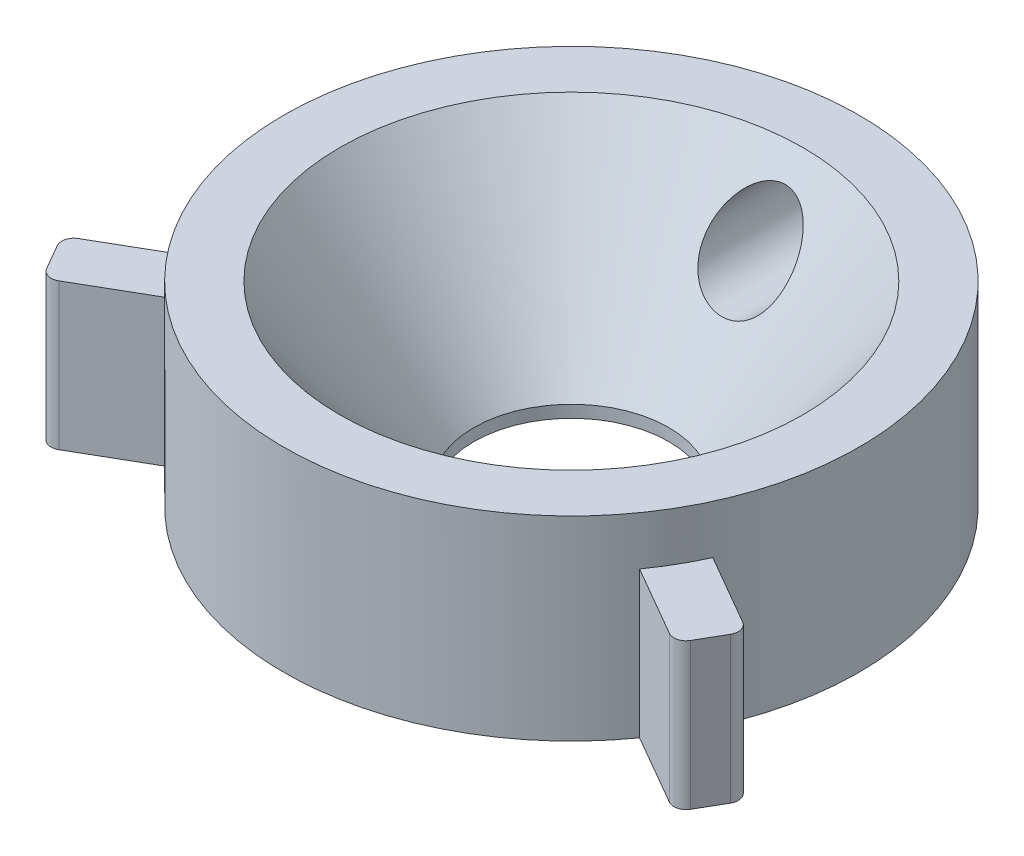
ISO-10303-21;
HEADER;
FILE_DESCRIPTION(('STEP AP214'),'2;1');
FILE_NAME('part.step','',(''),(''),'','','');
FILE_SCHEMA(('AUTOMOTIVE_DESIGN { 1 0 10303 214 1 1 1 1 }'));
ENDSEC;
DATA;
#1=APPLICATION_CONTEXT('core data for automotive mechanical design processes');
#2=APPLICATION_PROTOCOL_DEFINITION('international standard','automotive_design',2000,#1);
#3=PRODUCT_CONTEXT('',#1,'mechanical');
#4=PRODUCT('Part','Part','',(#3));
#5=PRODUCT_RELATED_PRODUCT_CATEGORY('part','',(#4));
#6=PRODUCT_DEFINITION_FORMATION('','',#4);
#7=PRODUCT_DEFINITION_CONTEXT('part definition',#1,'design');
#8=PRODUCT_DEFINITION('design','',#6,#7);
#9=PRODUCT_DEFINITION_SHAPE('','',#8);
#10=(LENGTH_UNIT() NAMED_UNIT(*) SI_UNIT(.MILLI.,.METRE.));
#11=(NAMED_UNIT(*) PLANE_ANGLE_UNIT() SI_UNIT($,.RADIAN.));
#12=(NAMED_UNIT(*) SI_UNIT($,.STERADIAN.) SOLID_ANGLE_UNIT());
#13=UNCERTAINTY_MEASURE_WITH_UNIT(LENGTH_MEASURE(1.E-05),#10,'distance_accuracy_value','');
#14=(GEOMETRIC_REPRESENTATION_CONTEXT(3) GLOBAL_UNCERTAINTY_ASSIGNED_CONTEXT((#13)) GLOBAL_UNIT_ASSIGNED_CONTEXT((#10,
#11,#12)) REPRESENTATION_CONTEXT('',''));
#15=CARTESIAN_POINT('',(0.,0.,0.));
#16=DIRECTION('',(0.,0.,1.));
#17=DIRECTION('',(1.,0.,0.));
#18=AXIS2_PLACEMENT_3D('',#15,#16,#17);
#19=CARTESIAN_POINT('',(0.,0.,0.));
#20=DIRECTION('',(0.,1.,0.));
#21=DIRECTION('',(1.,0.,0.));
#22=AXIS2_PLACEMENT_3D('',#19,#20,#21);
#23=CYLINDRICAL_SURFACE('',#22,11.8);
#24=CARTESIAN_POINT('',(0.,7.05000011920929,-11.8));
#25=CARTESIAN_POINT('',(-0.0280630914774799,7.05000229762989,-11.8000003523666));
#26=CARTESIAN_POINT('',(-0.056127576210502,7.04933109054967,-11.7998999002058));
#27=CARTESIAN_POINT('',(-0.111992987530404,7.04662930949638,-11.7995012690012));
#28=CARTESIAN_POINT('',(-0.139794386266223,7.04460825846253,-11.7992044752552));
#29=CARTESIAN_POINT('',(-0.195132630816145,7.03920730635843,-11.798418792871));
#30=CARTESIAN_POINT('',(-0.222670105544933,7.03583374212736,-11.7979308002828));
#31=CARTESIAN_POINT('',(-0.277478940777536,7.02773173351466,-11.7967688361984));
#32=CARTESIAN_POINT('',(-0.304750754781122,7.02300629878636,-11.7960952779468));
#33=CARTESIAN_POINT('',(-0.359027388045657,7.01220374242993,-11.7945680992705));
#34=CARTESIAN_POINT('',(-0.386032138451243,7.0061262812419,-11.7937144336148));
#35=CARTESIAN_POINT('',(-0.439774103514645,6.99262309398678,-11.791832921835));
#36=CARTESIAN_POINT('',(-0.466510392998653,6.98519375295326,-11.7908046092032));
#37=CARTESIAN_POINT('',(-0.519715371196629,6.96899003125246,-11.7885795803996));
#38=CARTESIAN_POINT('',(-0.546181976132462,6.96020892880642,-11.7873820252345));
#39=CARTESIAN_POINT('',(-0.598847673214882,6.94130482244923,-11.7848242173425));
#40=CARTESIAN_POINT('',(-0.625043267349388,6.93117224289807,-11.7834628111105));
#41=CARTESIAN_POINT('',(-0.676882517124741,6.90968603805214,-11.7805985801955));
#42=CARTESIAN_POINT('',(-0.702526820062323,6.89833395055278,-11.7790959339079));
#43=CARTESIAN_POINT('',(-0.753048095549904,6.87447765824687,-11.775973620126));
#44=CARTESIAN_POINT('',(-0.777929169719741,6.86198203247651,-11.7743548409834));
#45=CARTESIAN_POINT('',(-0.826924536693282,6.83584170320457,-11.771015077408));
#46=CARTESIAN_POINT('',(-0.851041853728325,6.82220260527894,-11.7692946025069));
#47=CARTESIAN_POINT('',(-0.898510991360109,6.79377834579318,-11.7657657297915));
#48=CARTESIAN_POINT('',(-0.921864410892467,6.7789958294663,-11.763957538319));
#49=CARTESIAN_POINT('',(-0.967807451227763,6.74828771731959,-11.7602670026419));
#50=CARTESIAN_POINT('',(-0.990396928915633,6.73236190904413,-11.7583846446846));
#51=CARTESIAN_POINT('',(-1.03481422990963,6.69937008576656,-11.7545590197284));
#52=CARTESIAN_POINT('',(-1.05663989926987,6.68230118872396,-11.752615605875));
#53=CARTESIAN_POINT('',(-1.09953207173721,6.64702573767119,-11.7486805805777));
#54=CARTESIAN_POINT('',(-1.12059420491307,6.62881389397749,-11.7466887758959));
#55=CARTESIAN_POINT('',(-1.16196212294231,6.591255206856,-11.7426691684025));
#56=CARTESIAN_POINT('',(-1.18226119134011,6.57190098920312,-11.7406412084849));
#57=CARTESIAN_POINT('',(-1.22193098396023,6.53223318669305,-11.7365788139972));
#58=CARTESIAN_POINT('',(-1.24130095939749,6.51191885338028,-11.7345443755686));
#59=CARTESIAN_POINT('',(-1.27888331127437,6.47052355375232,-11.7305077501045));
#60=CARTESIAN_POINT('',(-1.29710333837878,6.44944955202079,-11.7285054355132));
#61=CARTESIAN_POINT('',(-1.332389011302,6.40653768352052,-11.7245491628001));
#62=CARTESIAN_POINT('',(-1.34946021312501,6.38470440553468,-11.7225950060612));
#63=CARTESIAN_POINT('',(-1.38245180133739,6.34027631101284,-11.7187500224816));
#64=CARTESIAN_POINT('',(-1.3983753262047,6.31768383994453,-11.7168590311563));
#65=CARTESIAN_POINT('',(-1.42907543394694,6.2717396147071,-11.7131542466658));
#66=CARTESIAN_POINT('',(-1.44385247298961,6.248388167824,-11.711340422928));
#67=CARTESIAN_POINT('',(-1.47226377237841,6.20092803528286,-11.7078027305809));
#68=CARTESIAN_POINT('',(-1.48589561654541,6.17681788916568,-11.7060790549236));
#69=CARTESIAN_POINT('',(-1.51202058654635,6.12784194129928,-11.7027333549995));
#70=CARTESIAN_POINT('',(-1.52450831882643,6.10297323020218,-11.7011118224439));
#71=CARTESIAN_POINT('',(-1.5483500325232,6.05248204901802,-11.6979809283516));
#72=CARTESIAN_POINT('',(-1.55969563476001,6.02685557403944,-11.6964724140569));
#73=CARTESIAN_POINT('',(-1.58117319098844,5.97504444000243,-11.6935883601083));
#74=CARTESIAN_POINT('',(-1.59130321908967,5.94885897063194,-11.6922130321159));
#75=CARTESIAN_POINT('',(-1.61020037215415,5.8962126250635,-11.6896255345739));
#76=CARTESIAN_POINT('',(-1.61897708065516,5.8697552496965,-11.688412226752));
#77=CARTESIAN_POINT('',(-1.63517222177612,5.81656721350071,-11.6861575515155));
#78=CARTESIAN_POINT('',(-1.64259731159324,5.78983861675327,-11.685115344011));
#79=CARTESIAN_POINT('',(-1.65609311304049,5.73610943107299,-11.6832102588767));
#80=CARTESIAN_POINT('',(-1.66216731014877,5.70910973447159,-11.6823469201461));
#81=CARTESIAN_POINT('',(-1.67296547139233,5.65483951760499,-11.6808054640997));
#82=CARTESIAN_POINT('',(-1.67768958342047,5.62756902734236,-11.6801273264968));
#83=CARTESIAN_POINT('',(-1.68579175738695,5.57275804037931,-11.6789606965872));
#84=CARTESIAN_POINT('',(-1.68916656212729,5.54521705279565,-11.6784726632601));
#85=CARTESIAN_POINT('',(-1.69457360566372,5.48986547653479,-11.6776893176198));
#86=CARTESIAN_POINT('',(-1.69659921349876,5.46205422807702,-11.6773949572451));
#87=CARTESIAN_POINT('',(-1.69931316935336,5.40616243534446,-11.677000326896));
#88=CARTESIAN_POINT('',(-1.69999165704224,5.37808140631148,-11.6769014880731));
#89=CARTESIAN_POINT('',(-1.70000832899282,5.32196583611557,-11.676899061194));
#90=CARTESIAN_POINT('',(-1.69934875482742,5.29393129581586,-11.6769951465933));
#91=CARTESIAN_POINT('',(-1.69666565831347,5.2381191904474,-11.6773853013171));
#92=CARTESIAN_POINT('',(-1.69465143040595,5.2103411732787,-11.677678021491));
#93=CARTESIAN_POINT('',(-1.68926355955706,5.15504270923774,-11.6784586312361));
#94=CARTESIAN_POINT('',(-1.68589591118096,5.12752166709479,-11.6789456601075));
#95=CARTESIAN_POINT('',(-1.67780363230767,5.0727371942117,-11.6801109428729));
#96=CARTESIAN_POINT('',(-1.6730815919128,5.04547337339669,-11.6807888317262));
#97=CARTESIAN_POINT('',(-1.66228339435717,4.99120308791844,-11.6823304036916));
#98=CARTESIAN_POINT('',(-1.65620640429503,4.96419679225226,-11.6831942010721));
#99=CARTESIAN_POINT('',(-1.64270086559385,4.91044092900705,-11.6851007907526));
#100=CARTESIAN_POINT('',(-1.63526814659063,4.88369242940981,-11.6861441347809));
#101=CARTESIAN_POINT('',(-1.61905328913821,4.83045119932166,-11.6884016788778));
#102=CARTESIAN_POINT('',(-1.61026382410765,4.80396074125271,-11.6896168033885));
#103=CARTESIAN_POINT('',(-1.59133783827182,4.75123433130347,-11.6922083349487));
#104=CARTESIAN_POINT('',(-1.58119110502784,4.72500211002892,-11.6935859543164));
#105=CARTESIAN_POINT('',(-1.55970049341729,4.6731532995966,-11.6964717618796));
#106=CARTESIAN_POINT('',(-1.54836115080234,4.64753480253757,-11.697979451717));
#107=CARTESIAN_POINT('',(-1.52452954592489,4.59705756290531,-11.7011090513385));
#108=CARTESIAN_POINT('',(-1.51204555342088,4.57219486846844,-11.702730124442));
#109=CARTESIAN_POINT('',(-1.48592683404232,4.52322842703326,-11.7060750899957));
#110=CARTESIAN_POINT('',(-1.47229738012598,4.49912183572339,-11.7077985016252));
#111=CARTESIAN_POINT('',(-1.4438893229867,4.45166640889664,-11.7113358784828));
#112=CARTESIAN_POINT('',(-1.42911301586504,4.42831618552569,-11.7131496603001));
#113=CARTESIAN_POINT('',(-1.39841290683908,4.3823719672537,-11.7168545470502));
#114=CARTESIAN_POINT('',(-1.38248853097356,4.3597783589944,-11.7187456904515));
#115=CARTESIAN_POINT('',(-1.3494937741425,4.31534552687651,-11.7225911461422));
#116=CARTESIAN_POINT('',(-1.33242014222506,4.29350873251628,-11.7245456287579));
#117=CARTESIAN_POINT('',(-1.29712803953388,4.2505874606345,-11.7285027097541));
#118=CARTESIAN_POINT('',(-1.27890390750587,4.22950765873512,-11.7305055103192));
#119=CARTESIAN_POINT('',(-1.24131213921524,4.18809801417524,-11.7345432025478));
#120=CARTESIAN_POINT('',(-1.22193675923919,4.16777522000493,-11.7365782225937));
#121=CARTESIAN_POINT('',(-1.18226934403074,4.12810501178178,-11.7406403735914));
#122=CARTESIAN_POINT('',(-1.1619787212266,4.10875618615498,-11.7426675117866));
#123=CARTESIAN_POINT('',(-1.12062513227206,4.07120690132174,-11.7466858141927));
#124=CARTESIAN_POINT('',(-1.09956879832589,4.05299916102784,-11.7486771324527));
#125=CARTESIAN_POINT('',(-1.05668603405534,4.01773014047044,-11.7526114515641));
#126=CARTESIAN_POINT('',(-1.03486388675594,4.00066367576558,-11.7545546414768));
#127=CARTESIAN_POINT('',(-0.990451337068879,3.96767503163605,-11.7583800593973));
#128=CARTESIAN_POINT('',(-0.967863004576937,3.95175008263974,-11.7602624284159));
#129=CARTESIAN_POINT('',(-0.921919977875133,3.92104197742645,-11.7639531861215));
#130=CARTESIAN_POINT('',(-0.898565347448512,3.90625872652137,-11.7657615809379));
#131=CARTESIAN_POINT('',(-0.851091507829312,3.87783125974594,-11.76929101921));
#132=CARTESIAN_POINT('',(-0.826970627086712,3.86418980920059,-11.7710118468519));
#133=CARTESIAN_POINT('',(-0.777965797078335,3.83804314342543,-11.7743524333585));
#134=CARTESIAN_POINT('',(-0.753078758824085,3.82554365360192,-11.7759716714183));
#135=CARTESIAN_POINT('',(-0.702543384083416,3.80167759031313,-11.7790949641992));
#136=CARTESIAN_POINT('',(-0.676890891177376,3.79031970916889,-11.7805981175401));
#137=CARTESIAN_POINT('',(-0.625048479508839,3.76882811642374,-11.7834625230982));
#138=CARTESIAN_POINT('',(-0.598858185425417,3.75869529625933,-11.7848236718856));
#139=CARTESIAN_POINT('',(-0.546201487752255,3.7397909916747,-11.7873811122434));
#140=CARTESIAN_POINT('',(-0.51973856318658,3.73100998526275,-11.7885785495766));
#141=CARTESIAN_POINT('',(-0.46653951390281,3.7148063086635,-11.7908034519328));
#142=CARTESIAN_POINT('',(-0.439805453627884,3.70737697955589,-11.7918317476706));
#143=CARTESIAN_POINT('',(-0.386066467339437,3.69387377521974,-11.7937133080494));
#144=CARTESIAN_POINT('',(-0.359062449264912,3.68779635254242,-11.7945670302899));
#145=CARTESIAN_POINT('',(-0.304785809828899,3.67699379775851,-11.7960943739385));
#146=CARTESIAN_POINT('',(-0.277513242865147,3.67226839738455,-11.7967680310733));
#147=CARTESIAN_POINT('',(-0.222701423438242,3.66416638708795,-11.7979302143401));
#148=CARTESIAN_POINT('',(-0.195161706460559,3.66079286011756,-11.7984183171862));
#149=CARTESIAN_POINT('',(-0.139817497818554,3.65539190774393,-11.7992042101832));
#150=CARTESIAN_POINT('',(-0.112012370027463,3.65337089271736,-11.7995010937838));
#151=CARTESIAN_POINT('',(-0.0561380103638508,3.65066911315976,-11.7998998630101));
#152=CARTESIAN_POINT('',(-0.0280683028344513,3.64999794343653,-11.8000003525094));
#153=CARTESIAN_POINT('',(0.,3.65000011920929,-11.8));
#154=B_SPLINE_CURVE_WITH_KNOTS('',3,(#24,#25,#26,#27,#28,#29,#30,#31,#32,#33,#34,#35,#36,#37,
#38,#39,#40,#41,#42,#43,#44,#45,#46,#47,#48,#49,#50,#51,#52,#53,#54,#55,#56,#57,#58,#59,#60,#61,
#62,#63,#64,#65,#66,#67,#68,#69,#70,#71,#72,#73,#74,#75,#76,#77,#78,#79,#80,#81,#82,#83,#84,#85,
#86,#87,#88,#89,#90,#91,#92,#93,#94,#95,#96,#97,#98,#99,#100,#101,#102,#103,#104,#105,#106,#107,
#108,#109,#110,#111,#112,#113,#114,#115,#116,#117,#118,#119,#120,#121,#122,#123,#124,#125,#126,
#127,#128,#129,#130,#131,#132,#133,#134,#135,#136,#137,#138,#139,#140,#141,#142,#143,#144,#145,
#146,#147,#148,#149,#150,#151,#152,#153),.UNSPECIFIED.,.F.,.F.,(4,2,2,2,2,2,2,2,2,2,2,2,2,2,2,2,
2,2,2,2,2,2,2,2,2,2,2,2,2,2,2,2,2,2,2,2,2,2,2,2,2,2,2,2,2,2,2,2,2,2,2,2,2,2,2,2,2,2,2,2,2,2,2,2,
4),(0.,0.0841830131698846,0.167778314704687,0.250986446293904,0.334010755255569,
0.417055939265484,0.500326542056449,0.584025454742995,0.668352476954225,0.752574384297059,
0.836209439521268,0.919456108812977,1.00251564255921,1.08559065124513,1.16888363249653,
1.25259550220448,1.33692418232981,1.42131972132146,1.50507661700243,1.58839398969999,
1.67147412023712,1.75452102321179,1.83773895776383,1.92133092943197,2.00549723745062,
2.08979518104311,2.17346565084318,2.25671215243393,2.33974130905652,2.42276136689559,
2.50598064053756,2.589605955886,2.67384114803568,2.75793534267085,2.84145836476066,
2.92461545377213,3.00761456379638,3.09066483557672,3.17397502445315,3.25775194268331,
3.34219897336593,3.42633571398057,3.50990640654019,3.59311150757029,3.67615412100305,
3.7592385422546,3.84256875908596,3.92634696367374,4.01077212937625,4.09507118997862,
4.17876175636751,4.26204189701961,4.3451126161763,4.42817643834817,4.51143593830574,
4.59509226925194,4.67934374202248,4.76365615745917,4.84734445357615,4.9306085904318,
5.01365159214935,5.09667810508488,5.1798928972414,5.26349935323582,5.34769801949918),.UNSPECIFIED.);
#155=CARTESIAN_POINT('',(0.,7.05000011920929,-11.8));
#156=VERTEX_POINT('',#155);
#157=CARTESIAN_POINT('',(0.,3.65000011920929,-11.8));
#158=VERTEX_POINT('',#157);
#159=EDGE_CURVE('E429',#156,#158,#154,.T.);
#160=ORIENTED_EDGE('',*,*,#159,.T.);
#161=CARTESIAN_POINT('',(0.,3.65000011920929,-11.8));
#162=CARTESIAN_POINT('',(0.0280630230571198,3.64999794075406,-11.8000003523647));
#163=CARTESIAN_POINT('',(0.0561274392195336,3.65066914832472,-11.7998999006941));
#164=CARTESIAN_POINT('',(0.111992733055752,3.65337092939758,-11.7995012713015));
#165=CARTESIAN_POINT('',(0.13979408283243,3.65539198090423,-11.7992044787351));
#166=CARTESIAN_POINT('',(0.195132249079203,3.6607929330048,-11.7984187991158));
#167=CARTESIAN_POINT('',(0.222669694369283,3.66416649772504,-11.7979308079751));
#168=CARTESIAN_POINT('',(0.277478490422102,3.67226850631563,-11.7967688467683));
#169=CARTESIAN_POINT('',(0.304750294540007,3.6769939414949,-11.7960952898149));
#170=CARTESIAN_POINT('',(0.359026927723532,3.68779649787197,-11.7945681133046));
#171=CARTESIAN_POINT('',(0.38603168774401,3.69387395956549,-11.7937144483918));
#172=CARTESIAN_POINT('',(0.43977369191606,3.70737714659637,-11.7918329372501));
#173=CARTESIAN_POINT('',(0.466510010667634,3.71480648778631,-11.7908046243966));
#174=CARTESIAN_POINT('',(0.519715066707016,3.73101021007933,-11.788579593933));
#175=CARTESIAN_POINT('',(0.546181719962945,3.73979131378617,-11.787382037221));
#176=CARTESIAN_POINT('',(0.598847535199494,3.75869541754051,-11.7848242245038));
#177=CARTESIAN_POINT('',(0.625043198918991,3.76882799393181,-11.7834628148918));
#178=CARTESIAN_POINT('',(0.676882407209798,3.79031412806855,-11.7805985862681));
#179=CARTESIAN_POINT('',(0.702526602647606,3.80166613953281,-11.7790959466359));
#180=CARTESIAN_POINT('',(0.753047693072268,3.82552230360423,-11.7759736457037));
#181=CARTESIAN_POINT('',(0.777928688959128,3.83801787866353,-11.7743548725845));
#182=CARTESIAN_POINT('',(0.826923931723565,3.86415812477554,-11.7710151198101));
#183=CARTESIAN_POINT('',(0.851041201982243,3.8777971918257,-11.7692946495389));
#184=CARTESIAN_POINT('',(0.898510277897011,3.90622140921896,-11.7657657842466));
#185=CARTESIAN_POINT('',(0.921863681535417,3.92100391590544,-11.763957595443));
#186=CARTESIAN_POINT('',(0.967806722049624,3.95171202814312,-11.7602670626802));
#187=CARTESIAN_POINT('',(0.990396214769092,3.96763784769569,-11.7583847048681));
#188=CARTESIAN_POINT('',(1.03481357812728,4.00062971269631,-11.7545590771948));
#189=CARTESIAN_POINT('',(1.05663929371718,4.0176986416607,-11.7526156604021));
#190=CARTESIAN_POINT('',(1.09953158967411,4.05297417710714,-11.7486806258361));
#191=CARTESIAN_POINT('',(1.12059379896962,4.07118607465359,-11.7466888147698));
#192=CARTESIAN_POINT('',(1.16196190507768,4.10874488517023,-11.7426691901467));
#193=CARTESIAN_POINT('',(1.18226108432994,4.12809917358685,-11.7406412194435));
#194=CARTESIAN_POINT('',(1.22193090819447,4.16776694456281,-11.7365788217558));
#195=CARTESIAN_POINT('',(1.24130081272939,4.18808116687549,-11.7345443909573));
#196=CARTESIAN_POINT('',(1.27888304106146,4.22947627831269,-11.7305077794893));
#197=CARTESIAN_POINT('',(1.2971030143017,4.25055020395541,-11.7285054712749));
#198=CARTESIAN_POINT('',(1.33238860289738,4.29346194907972,-11.7245492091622));
#199=CARTESIAN_POINT('',(1.34945977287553,4.31529518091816,-11.7225950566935));
#200=CARTESIAN_POINT('',(1.3824513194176,4.3597232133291,-11.718750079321));
#201=CARTESIAN_POINT('',(1.39837483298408,4.38231566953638,-11.7168590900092));
#202=CARTESIAN_POINT('',(1.42907494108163,4.42825989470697,-11.7131543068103));
#203=CARTESIAN_POINT('',(1.44385199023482,4.45161135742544,-11.7113404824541));
#204=CARTESIAN_POINT('',(1.4722633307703,4.49907155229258,-11.7078027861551));
#205=CARTESIAN_POINT('',(1.48589520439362,4.52318174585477,-11.7060791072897));
#206=CARTESIAN_POINT('',(1.51202026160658,4.57215781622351,-11.702733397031));
#207=CARTESIAN_POINT('',(1.52450805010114,4.59702660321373,-11.7011118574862));
#208=CARTESIAN_POINT('',(1.5483498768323,4.64751797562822,-11.6979809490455));
#209=CARTESIAN_POINT('',(1.55969553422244,4.67314456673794,-11.696472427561));
#210=CARTESIAN_POINT('',(1.58117397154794,4.7249575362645,-11.6935882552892));
#211=CARTESIAN_POINT('',(1.59130474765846,4.75114475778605,-11.6922128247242));
#212=CARTESIAN_POINT('',(1.6102031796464,4.80379410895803,-11.6896251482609));
#213=CARTESIAN_POINT('',(1.61898044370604,4.83025272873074,-11.6884117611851));
#214=CARTESIAN_POINT('',(1.63517644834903,4.88344276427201,-11.6861569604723));
#215=CARTESIAN_POINT('',(1.64260187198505,4.91017210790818,-11.6851147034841));
#216=CARTESIAN_POINT('',(1.65609810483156,4.96390229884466,-11.6832095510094));
#217=CARTESIAN_POINT('',(1.66217242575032,4.99090224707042,-11.6823461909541));
#218=CARTESIAN_POINT('',(1.67297057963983,5.0451724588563,-11.680804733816));
#219=CARTESIAN_POINT('',(1.67769458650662,5.0724426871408,-11.6801266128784));
#220=CARTESIAN_POINT('',(1.68579635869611,5.12725271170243,-11.678960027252));
#221=CARTESIAN_POINT('',(1.68917089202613,5.15479299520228,-11.6784720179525));
#222=CARTESIAN_POINT('',(1.69457696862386,5.2101424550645,-11.6776888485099));
#223=CARTESIAN_POINT('',(1.69660190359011,5.2379522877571,-11.6773946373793));
#224=CARTESIAN_POINT('',(1.69931496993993,5.29384154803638,-11.6769999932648));
#225=CARTESIAN_POINT('',(1.69999326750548,5.32192146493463,-11.6769009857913));
#226=CARTESIAN_POINT('',(1.70000000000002,5.35000011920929,-11.6769002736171));
#227=B_SPLINE_CURVE_WITH_KNOTS('',3,(#161,#162,#163,#164,#165,#166,#167,#168,#169,#170,#171,
#172,#173,#174,#175,#176,#177,#178,#179,#180,#181,#182,#183,#184,#185,#186,#187,#188,#189,#190,
#191,#192,#193,#194,#195,#196,#197,#198,#199,#200,#201,#202,#203,#204,#205,#206,#207,#208,#209,
#210,#211,#212,#213,#214,#215,#216,#217,#218,#219,#220,#221,#222,#223,#224,#225,#226),
.UNSPECIFIED.,.F.,.F.,(4,2,2,2,2,2,2,2,2,2,2,2,2,2,2,2,2,2,2,2,2,2,2,2,2,2,2,2,2,2,2,2,4),(0.,
0.0841828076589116,0.167777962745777,0.250986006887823,0.334010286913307,0.417055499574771,
0.500326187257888,0.584025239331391,0.668352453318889,0.752573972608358,0.836208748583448,
0.919455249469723,1.00251472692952,1.0855897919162,1.16888294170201,1.25259509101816,
1.33692415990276,1.42131931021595,1.50507592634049,1.58839313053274,1.67147320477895,
1.75452016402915,1.83773826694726,1.92133051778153,2.00549721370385,2.0898008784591,
2.17347542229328,2.25672435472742,2.33975431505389,2.42277357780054,2.50599049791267,
2.58961195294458,2.67384183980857),.UNSPECIFIED.);
#228=CARTESIAN_POINT('',(1.7,5.35000011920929,-11.6769002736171));
#229=VERTEX_POINT('',#228);
#230=EDGE_CURVE('E147',#158,#229,#227,.T.);
#231=ORIENTED_EDGE('',*,*,#230,.T.);
#232=CARTESIAN_POINT('',(1.70000000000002,5.35000011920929,-11.6769002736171));
#233=CARTESIAN_POINT('',(1.69999327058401,5.37807343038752,-11.6769009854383));
#234=CARTESIAN_POINT('',(1.69931493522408,5.40614799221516,-11.6769999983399));
#235=CARTESIAN_POINT('',(1.69660186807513,5.46202807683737,-11.6773946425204));
#236=CARTESIAN_POINT('',(1.69457689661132,5.48983408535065,-11.6776888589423));
#237=CARTESIAN_POINT('',(1.68917082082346,5.54517742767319,-11.6784720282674));
#238=CARTESIAN_POINT('',(1.68579624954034,5.57271541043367,-11.6789600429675));
#239=CARTESIAN_POINT('',(1.67769447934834,5.6275223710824,-11.6801266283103));
#240=CARTESIAN_POINT('',(1.67297043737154,5.65479182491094,-11.6808047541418));
#241=CARTESIAN_POINT('',(1.66217228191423,5.70906202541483,-11.6823462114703));
#242=CARTESIAN_POINT('',(1.65609792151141,5.73606272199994,-11.6832095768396));
#243=CARTESIAN_POINT('',(1.642601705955,5.78979596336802,-11.6851147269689));
#244=CARTESIAN_POINT('',(1.63517626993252,5.81652759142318,-11.686156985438));
#245=CARTESIAN_POINT('',(1.61898021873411,5.86972370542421,-11.6884117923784));
#246=CARTESIAN_POINT('',(1.61020285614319,5.89618609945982,-11.6896251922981));
#247=CARTESIAN_POINT('',(1.59130462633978,5.94884468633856,-11.6922128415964));
#248=CARTESIAN_POINT('',(1.58117409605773,5.97503734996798,-11.6935882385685));
#249=CARTESIAN_POINT('',(1.55970118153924,6.02684708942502,-11.696471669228));
#250=CARTESIAN_POINT('',(1.5483614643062,6.05246528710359,-11.6979794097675));
#251=CARTESIAN_POINT('',(1.52452966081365,6.10294220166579,-11.7011090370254));
#252=CARTESIAN_POINT('',(1.51204583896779,6.12780486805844,-11.7027300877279));
#253=CARTESIAN_POINT('',(1.48592729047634,6.176771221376,-11.7060750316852));
#254=CARTESIAN_POINT('',(1.47229783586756,6.2008777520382,-11.7077984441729));
#255=CARTESIAN_POINT('',(1.44388979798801,6.24833310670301,-11.7113358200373));
#256=CARTESIAN_POINT('',(1.42911350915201,6.27168331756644,-11.7131496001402));
#257=CARTESIAN_POINT('',(1.39841340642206,6.31762753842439,-11.7168544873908));
#258=CARTESIAN_POINT('',(1.3824890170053,6.34022116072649,-11.7187456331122));
#259=CARTESIAN_POINT('',(1.34949421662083,6.3846540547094,-11.7225910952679));
#260=CARTESIAN_POINT('',(1.33242055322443,6.40649089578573,-11.7245455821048));
#261=CARTESIAN_POINT('',(1.2971283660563,6.44941229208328,-11.7285026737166));
#262=CARTESIAN_POINT('',(1.27890417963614,6.47049217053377,-11.7305054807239));
#263=CARTESIAN_POINT('',(1.24131228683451,6.51190200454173,-11.734543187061));
#264=CARTESIAN_POINT('',(1.22193683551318,6.53222491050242,-11.7365782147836));
#265=CARTESIAN_POINT('',(1.18226945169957,6.57189515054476,-11.7406403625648));
#266=CARTESIAN_POINT('',(1.16197894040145,6.59124390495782,-11.7426674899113));
#267=CARTESIAN_POINT('',(1.12062554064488,6.62879306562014,-11.7466857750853));
#268=CARTESIAN_POINT('',(1.09956928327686,6.64700075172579,-11.7486770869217));
#269=CARTESIAN_POINT('',(1.05668664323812,6.68226968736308,-11.7526113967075));
#270=CARTESIAN_POINT('',(1.03486454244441,6.69933611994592,-11.7545545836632));
#271=CARTESIAN_POINT('',(0.990452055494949,6.73232472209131,-11.7583799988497));
#272=CARTESIAN_POINT('',(0.967863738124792,6.74824965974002,-11.7602623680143));
#273=CARTESIAN_POINT('',(0.921920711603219,6.7789577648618,-11.7639531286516));
#274=CARTESIAN_POINT('',(0.898566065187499,6.79374102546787,-11.7657615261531));
#275=CARTESIAN_POINT('',(0.851092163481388,6.82216853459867,-11.7692909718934));
#276=CARTESIAN_POINT('',(0.826971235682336,6.83581001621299,-11.7710118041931));
#277=CARTESIAN_POINT('',(0.777966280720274,6.86195676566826,-11.7743524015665));
#278=CARTESIAN_POINT('',(0.753079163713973,6.87445630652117,-11.7759716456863));
#279=CARTESIAN_POINT('',(0.702543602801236,6.89832249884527,-11.7790949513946));
#280=CARTESIAN_POINT('',(0.676891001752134,6.90968045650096,-11.780598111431));
#281=CARTESIAN_POINT('',(0.625048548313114,6.93117212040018,-11.7834625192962));
#282=CARTESIAN_POINT('',(0.598858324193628,6.94130494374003,-11.7848236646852));
#283=CARTESIAN_POINT('',(0.546201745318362,6.96020925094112,-11.7873811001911));
#284=CARTESIAN_POINT('',(0.519738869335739,6.9689902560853,-11.7885785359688));
#285=CARTESIAN_POINT('',(0.46653989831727,6.98519393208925,-11.7908034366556));
#286=CARTESIAN_POINT('',(0.439805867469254,6.99262326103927,-11.7918317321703));
#287=CARTESIAN_POINT('',(0.386066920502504,7.00612646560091,-11.7937132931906));
#288=CARTESIAN_POINT('',(0.359062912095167,7.01220388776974,-11.794567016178));
#289=CARTESIAN_POINT('',(0.304786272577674,7.0230064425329,-11.7960943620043));
#290=CARTESIAN_POINT('',(0.277513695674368,7.02773184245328,-11.7967680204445));
#291=CARTESIAN_POINT('',(0.222701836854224,7.03583385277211,-11.7979302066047));
#292=CARTESIAN_POINT('',(0.19516209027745,7.0392073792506,-11.7984183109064));
#293=CARTESIAN_POINT('',(0.139817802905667,7.04460833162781,-11.7992042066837));
#294=CARTESIAN_POINT('',(0.112012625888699,7.04662934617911,-11.7995010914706));
#295=CARTESIAN_POINT('',(0.0561381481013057,7.04933112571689,-11.7998998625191));
#296=CARTESIAN_POINT('',(0.0280683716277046,7.05000229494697,-11.8000003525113));
#297=CARTESIAN_POINT('',(0.,7.05000011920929,-11.8));
#298=B_SPLINE_CURVE_WITH_KNOTS('',3,(#232,#233,#234,#235,#236,#237,#238,#239,#240,#241,#242,
#243,#244,#245,#246,#247,#248,#249,#250,#251,#252,#253,#254,#255,#256,#257,#258,#259,#260,#261,
#262,#263,#264,#265,#266,#267,#268,#269,#270,#271,#272,#273,#274,#275,#276,#277,#278,#279,#280,
#281,#282,#283,#284,#285,#286,#287,#288,#289,#290,#291,#292,#293,#294,#295,#296,#297),
.UNSPECIFIED.,.F.,.F.,(4,2,2,2,2,2,2,2,2,2,2,2,2,2,2,2,2,2,2,2,2,2,2,2,2,2,2,2,2,2,2,2,4),(0.,
0.0842138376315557,0.167823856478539,0.251033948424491,0.334050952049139,0.417083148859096,
0.500338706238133,0.584024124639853,0.668342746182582,0.752479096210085,0.836049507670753,
0.919254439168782,1.00229699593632,1.08538147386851,1.16871186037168,1.25249034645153,
1.33691590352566,1.42121457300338,1.50490485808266,1.5881848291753,1.67125549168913,
1.75431937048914,1.83757903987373,1.92123565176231,2.00548751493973,2.08979973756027,
2.1734878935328,2.25675194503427,2.3397949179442,2.42282145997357,2.50603634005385,
2.58964294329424,2.67384181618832),.UNSPECIFIED.);
#299=EDGE_CURVE('E136',#229,#156,#298,.T.);
#300=ORIENTED_EDGE('',*,*,#299,.T.);
#301=EDGE_LOOP('',(#160,#231,#300));
#302=FACE_BOUND('',#301,.T.);
#303=CARTESIAN_POINT('',(0.,8.,0.));
#304=DIRECTION('',(0.,1.,0.));
#305=DIRECTION('',(1.,0.,0.));
#306=AXIS2_PLACEMENT_3D('',#303,#304,#305);
#307=CIRCLE('',#306,11.8);
#308=CARTESIAN_POINT('',(-11.8,8.,0.));
#309=VERTEX_POINT('',#308);
#310=EDGE_CURVE('E281',#309,#309,#307,.T.);
#311=ORIENTED_EDGE('',*,*,#310,.F.);
#312=DIRECTION('',(0.,-1.,0.));
#313=VECTOR('',#312,1.);
#314=CARTESIAN_POINT('',(-11.8,0.,0.));
#315=LINE('',#314,#313);
#316=CARTESIAN_POINT('',(-11.8,0.,0.));
#317=VERTEX_POINT('',#316);
#318=EDGE_CURVE('E11',#309,#317,#315,.T.);
#319=ORIENTED_EDGE('',*,*,#318,.T.);
#320=CARTESIAN_POINT('',(0.,0.,0.));
#321=DIRECTION('',(0.,1.,0.));
#322=DIRECTION('',(1.,0.,0.));
#323=AXIS2_PLACEMENT_3D('',#320,#321,#322);
#324=CIRCLE('',#323,11.8);
#325=CARTESIAN_POINT('',(-10.724600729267,0.,4.92168052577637));
#326=VERTEX_POINT('',#325);
#327=EDGE_CURVE('E242',#317,#326,#324,.T.);
#328=ORIENTED_EDGE('',*,*,#327,.T.);
#329=DIRECTION('',(0.,1.,0.));
#330=VECTOR('',#329,1.);
#331=CARTESIAN_POINT('',(-10.724600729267,0.,4.92168052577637));
#332=LINE('',#331,#330);
#333=CARTESIAN_POINT('',(-10.724600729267,6.,4.92168052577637));
#334=VERTEX_POINT('',#333);
#335=EDGE_CURVE('E30',#326,#334,#332,.T.);
#336=ORIENTED_EDGE('',*,*,#335,.T.);
#337=CARTESIAN_POINT('',(0.,6.,0.));
#338=DIRECTION('',(0.,1.,0.));
#339=DIRECTION('',(1.,0.,0.));
#340=AXIS2_PLACEMENT_3D('',#337,#338,#339);
#341=CIRCLE('',#340,11.8);
#342=CARTESIAN_POINT('',(-9.62460072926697,6.,6.82693641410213));
#343=VERTEX_POINT('',#342);
#344=EDGE_CURVE('E199',#334,#343,#341,.T.);
#345=ORIENTED_EDGE('',*,*,#344,.T.);
#346=DIRECTION('',(0.,1.,0.));
#347=VECTOR('',#346,1.);
#348=CARTESIAN_POINT('',(-9.62460072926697,0.,6.82693641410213));
#349=LINE('',#348,#347);
#350=CARTESIAN_POINT('',(-9.62460072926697,0.,6.82693641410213));
#351=VERTEX_POINT('',#350);
#352=EDGE_CURVE('E44',#351,#343,#349,.T.);
#353=ORIENTED_EDGE('',*,*,#352,.F.);
#354=CARTESIAN_POINT('',(0.,0.,0.));
#355=DIRECTION('',(0.,1.,0.));
#356=DIRECTION('',(1.,0.,0.));
#357=AXIS2_PLACEMENT_3D('',#354,#355,#356);
#358=CIRCLE('',#357,11.8);
#359=CARTESIAN_POINT('',(9.62460072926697,0.,6.82693641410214));
#360=VERTEX_POINT('',#359);
#361=EDGE_CURVE('E232',#351,#360,#358,.T.);
#362=ORIENTED_EDGE('',*,*,#361,.T.);
#363=DIRECTION('',(0.,1.,0.));
#364=VECTOR('',#363,1.);
#365=CARTESIAN_POINT('',(9.62460072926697,0.,6.82693641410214));
#366=LINE('',#365,#364);
#367=CARTESIAN_POINT('',(9.62460072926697,6.,6.82693641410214));
#368=VERTEX_POINT('',#367);
#369=EDGE_CURVE('E259',#360,#368,#366,.T.);
#370=ORIENTED_EDGE('',*,*,#369,.T.);
#371=CARTESIAN_POINT('',(0.,6.,0.));
#372=DIRECTION('',(0.,1.,0.));
#373=DIRECTION('',(1.,0.,0.));
#374=AXIS2_PLACEMENT_3D('',#371,#372,#373);
#375=CIRCLE('',#374,11.8);
#376=CARTESIAN_POINT('',(10.724600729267,6.,4.92168052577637));
#377=VERTEX_POINT('',#376);
#378=EDGE_CURVE('E274',#368,#377,#375,.T.);
#379=ORIENTED_EDGE('',*,*,#378,.T.);
#380=DIRECTION('',(0.,1.,0.));
#381=VECTOR('',#380,1.);
#382=CARTESIAN_POINT('',(10.724600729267,0.,4.92168052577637));
#383=LINE('',#382,#381);
#384=CARTESIAN_POINT('',(10.724600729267,0.,4.92168052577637));
#385=VERTEX_POINT('',#384);
#386=EDGE_CURVE('E66',#385,#377,#383,.T.);
#387=ORIENTED_EDGE('',*,*,#386,.F.);
#388=CARTESIAN_POINT('',(0.,0.,0.));
#389=DIRECTION('',(0.,1.,0.));
#390=DIRECTION('',(1.,0.,0.));
#391=AXIS2_PLACEMENT_3D('',#388,#389,#390);
#392=CIRCLE('',#391,11.8);
#393=EDGE_CURVE('E245',#385,#317,#392,.T.);
#394=ORIENTED_EDGE('',*,*,#393,.T.);
#395=ORIENTED_EDGE('',*,*,#318,.F.);
#396=EDGE_LOOP('',(#311,#319,#328,#336,#345,#353,#362,#370,#379,#387,#394,#395));
#397=FACE_BOUND('',#396,.T.);
#398=ADVANCED_FACE('F17',(#302,#397),#23,.T.);
#399=CARTESIAN_POINT('',(-10.724600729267,0.,4.92168052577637));
#400=DIRECTION('',(-0.5,0.,-0.866025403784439));
#401=DIRECTION('',(-0.866025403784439,0.,0.5));
#402=AXIS2_PLACEMENT_3D('',#399,#400,#401);
#403=PLANE('',#402);
#404=DIRECTION('',(0.,-1.,0.));
#405=VECTOR('',#404,1.);
#406=CARTESIAN_POINT('',(-13.626983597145,0.,6.59737205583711));
#407=LINE('',#406,#405);
#408=CARTESIAN_POINT('',(-13.626983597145,6.,6.59737205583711));
#409=VERTEX_POINT('',#408);
#410=CARTESIAN_POINT('',(-13.626983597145,0.,6.59737205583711));
#411=VERTEX_POINT('',#410);
#412=EDGE_CURVE('E205',#409,#411,#407,.T.);
#413=ORIENTED_EDGE('',*,*,#412,.F.);
#414=DIRECTION('',(0.866025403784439,0.,-0.5));
#415=VECTOR('',#414,1.);
#416=CARTESIAN_POINT('',(-7.1175876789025,6.,2.83917057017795));
#417=LINE('',#416,#415);
#418=EDGE_CURVE('E192',#409,#334,#417,.T.);
#419=ORIENTED_EDGE('',*,*,#418,.T.);
#420=ORIENTED_EDGE('',*,*,#335,.F.);
#421=DIRECTION('',(-0.866025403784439,0.,0.5));
#422=VECTOR('',#421,1.);
#423=CARTESIAN_POINT('',(-0.55,0.,-0.952627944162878));
#424=LINE('',#423,#422);
#425=EDGE_CURVE('E208',#326,#411,#424,.T.);
#426=ORIENTED_EDGE('',*,*,#425,.T.);
#427=EDGE_LOOP('',(#413,#419,#420,#426));
#428=FACE_BOUND('',#427,.T.);
#429=ADVANCED_FACE('F206',(#428),#403,.T.);
#430=CARTESIAN_POINT('',(-12.9599962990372,0.,8.75262794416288));
#431=DIRECTION('',(0.5,0.,0.866025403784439));
#432=DIRECTION('',(0.,-1.,0.));
#433=AXIS2_PLACEMENT_3D('',#430,#431,#432);
#434=PLANE('',#433);
#435=DIRECTION('',(0.,1.,0.));
#436=VECTOR('',#435,1.);
#437=CARTESIAN_POINT('',(-12.526983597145,0.,8.50262794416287));
#438=LINE('',#437,#436);
#439=CARTESIAN_POINT('',(-12.526983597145,0.,8.50262794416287));
#440=VERTEX_POINT('',#439);
#441=CARTESIAN_POINT('',(-12.526983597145,6.,8.50262794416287));
#442=VERTEX_POINT('',#441);
#443=EDGE_CURVE('E312',#440,#442,#438,.T.);
#444=ORIENTED_EDGE('',*,*,#443,.F.);
#445=DIRECTION('',(-0.866025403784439,0.,0.5));
#446=VECTOR('',#445,1.);
#447=CARTESIAN_POINT('',(0.55,0.,0.952627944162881));
#448=LINE('',#447,#446);
#449=EDGE_CURVE('E228',#351,#440,#448,.T.);
#450=ORIENTED_EDGE('',*,*,#449,.F.);
#451=ORIENTED_EDGE('',*,*,#352,.T.);
#452=DIRECTION('',(-0.866025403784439,0.,0.5));
#453=VECTOR('',#452,1.);
#454=CARTESIAN_POINT('',(-7.68528546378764,6.,5.70727222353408));
#455=LINE('',#454,#453);
#456=EDGE_CURVE('E252',#343,#442,#455,.T.);
#457=ORIENTED_EDGE('',*,*,#456,.T.);
#458=EDGE_LOOP('',(#444,#450,#451,#457));
#459=FACE_BOUND('',#458,.T.);
#460=ADVANCED_FACE('F738',(#459),#434,.T.);
#461=CARTESIAN_POINT('',(9.62460072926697,0.,6.82693641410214));
#462=DIRECTION('',(-0.5,0.,0.866025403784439));
#463=DIRECTION('',(0.,1.,0.));
#464=AXIS2_PLACEMENT_3D('',#461,#462,#463);
#465=PLANE('',#464);
#466=DIRECTION('',(0.,-1.,0.));
#467=VECTOR('',#466,1.);
#468=CARTESIAN_POINT('',(12.526983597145,0.,8.50262794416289));
#469=LINE('',#468,#467);
#470=CARTESIAN_POINT('',(12.526983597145,6.,8.50262794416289));
#471=VERTEX_POINT('',#470);
#472=CARTESIAN_POINT('',(12.526983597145,0.,8.50262794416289));
#473=VERTEX_POINT('',#472);
#474=EDGE_CURVE('E302',#471,#473,#469,.T.);
#475=ORIENTED_EDGE('',*,*,#474,.F.);
#476=DIRECTION('',(-0.866025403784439,0.,-0.5));
#477=VECTOR('',#476,1.);
#478=CARTESIAN_POINT('',(6.0175876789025,6.,4.74442645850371));
#479=LINE('',#478,#477);
#480=EDGE_CURVE('E226',#471,#368,#479,.T.);
#481=ORIENTED_EDGE('',*,*,#480,.T.);
#482=ORIENTED_EDGE('',*,*,#369,.F.);
#483=DIRECTION('',(0.866025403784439,0.,0.5));
#484=VECTOR('',#483,1.);
#485=CARTESIAN_POINT('',(-0.55,0.,0.952627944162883));
#486=LINE('',#485,#484);
#487=EDGE_CURVE('E237',#360,#473,#486,.T.);
#488=ORIENTED_EDGE('',*,*,#487,.T.);
#489=EDGE_LOOP('',(#475,#481,#482,#488));
#490=FACE_BOUND('',#489,.T.);
#491=ADVANCED_FACE('F382',(#490),#465,.T.);
#492=CARTESIAN_POINT('',(14.0599962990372,0.,6.84737205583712));
#493=DIRECTION('',(0.5,0.,-0.866025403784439));
#494=DIRECTION('',(0.,-1.,0.));
#495=AXIS2_PLACEMENT_3D('',#492,#493,#494);
#496=PLANE('',#495);
#497=DIRECTION('',(0.,1.,0.));
#498=VECTOR('',#497,1.);
#499=CARTESIAN_POINT('',(13.626983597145,0.,6.59737205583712));
#500=LINE('',#499,#498);
#501=CARTESIAN_POINT('',(13.626983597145,0.,6.59737205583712));
#502=VERTEX_POINT('',#501);
#503=CARTESIAN_POINT('',(13.626983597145,6.,6.59737205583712));
#504=VERTEX_POINT('',#503);
#505=EDGE_CURVE('E263',#502,#504,#500,.T.);
#506=ORIENTED_EDGE('',*,*,#505,.F.);
#507=DIRECTION('',(0.866025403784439,0.,0.5));
#508=VECTOR('',#507,1.);
#509=CARTESIAN_POINT('',(0.55,0.,-0.952627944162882));
#510=LINE('',#509,#508);
#511=EDGE_CURVE('E241',#385,#502,#510,.T.);
#512=ORIENTED_EDGE('',*,*,#511,.F.);
#513=ORIENTED_EDGE('',*,*,#386,.T.);
#514=DIRECTION('',(0.866025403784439,0.,0.5));
#515=VECTOR('',#514,1.);
#516=CARTESIAN_POINT('',(8.78528546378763,6.,3.80201633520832));
#517=LINE('',#516,#515);
#518=EDGE_CURVE('E270',#377,#504,#517,.T.);
#519=ORIENTED_EDGE('',*,*,#518,.T.);
#520=EDGE_LOOP('',(#506,#512,#513,#519));
#521=FACE_BOUND('',#520,.T.);
#522=ADVANCED_FACE('F349',(#521),#496,.T.);
#523=CARTESIAN_POINT('',(0.,0.,0.));
#524=DIRECTION('',(0.,1.,0.));
#525=DIRECTION('',(1.,0.,0.));
#526=AXIS2_PLACEMENT_3D('',#523,#524,#525);
#527=PLANE('',#526);
#528=CARTESIAN_POINT('',(0.,0.,0.));
#529=DIRECTION('',(0.,1.,0.));
#530=DIRECTION('',(1.,0.,0.));
#531=AXIS2_PLACEMENT_3D('',#528,#529,#530);
#532=CIRCLE('',#531,9.9);
#533=CARTESIAN_POINT('',(-9.9,0.,0.));
#534=VERTEX_POINT('',#533);
#535=EDGE_CURVE('E276',#534,#534,#532,.T.);
#536=ORIENTED_EDGE('',*,*,#535,.T.);
#537=EDGE_LOOP('',(#536));
#538=FACE_BOUND('',#537,.T.);
#539=CARTESIAN_POINT('',(-13.376983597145,0.,7.03038475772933));
#540=DIRECTION('',(0.,1.,0.));
#541=DIRECTION('',(-0.96592582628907,0.,-0.258819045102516));
#542=AXIS2_PLACEMENT_3D('',#539,#540,#541);
#543=CIRCLE('',#542,0.5);
#544=CARTESIAN_POINT('',(-13.8099962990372,0.,7.28038475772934));
#545=VERTEX_POINT('',#544);
#546=EDGE_CURVE('E213',#411,#545,#543,.T.);
#547=ORIENTED_EDGE('',*,*,#546,.F.);
#548=ORIENTED_EDGE('',*,*,#425,.F.);
#549=ORIENTED_EDGE('',*,*,#327,.F.);
#550=ORIENTED_EDGE('',*,*,#393,.F.);
#551=ORIENTED_EDGE('',*,*,#511,.T.);
#552=CARTESIAN_POINT('',(13.376983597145,0.,7.03038475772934));
#553=DIRECTION('',(0.,1.,0.));
#554=DIRECTION('',(0.965925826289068,0.,-0.258819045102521));
#555=AXIS2_PLACEMENT_3D('',#552,#553,#554);
#556=CIRCLE('',#555,0.5);
#557=CARTESIAN_POINT('',(13.8099962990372,0.,7.28038475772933));
#558=VERTEX_POINT('',#557);
#559=EDGE_CURVE('E266',#558,#502,#556,.T.);
#560=ORIENTED_EDGE('',*,*,#559,.F.);
#561=DIRECTION('',(-0.5,0.,0.866025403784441));
#562=VECTOR('',#561,1.);
#563=CARTESIAN_POINT('',(13.5099962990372,0.,7.8));
#564=LINE('',#563,#562);
#565=CARTESIAN_POINT('',(13.2099962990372,0.,8.31961524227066));
#566=VERTEX_POINT('',#565);
#567=EDGE_CURVE('E330',#558,#566,#564,.T.);
#568=ORIENTED_EDGE('',*,*,#567,.T.);
#569=CARTESIAN_POINT('',(12.776983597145,0.,8.06961524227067));
#570=DIRECTION('',(0.,1.,0.));
#571=DIRECTION('',(0.258819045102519,0.,0.965925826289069));
#572=AXIS2_PLACEMENT_3D('',#569,#570,#571);
#573=CIRCLE('',#572,0.5);
#574=EDGE_CURVE('E297',#473,#566,#573,.T.);
#575=ORIENTED_EDGE('',*,*,#574,.F.);
#576=ORIENTED_EDGE('',*,*,#487,.F.);
#577=ORIENTED_EDGE('',*,*,#361,.F.);
#578=ORIENTED_EDGE('',*,*,#449,.T.);
#579=CARTESIAN_POINT('',(-12.776983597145,0.,8.06961524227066));
#580=DIRECTION('',(0.,1.,0.));
#581=DIRECTION('',(-0.258819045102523,0.,0.965925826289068));
#582=AXIS2_PLACEMENT_3D('',#579,#580,#581);
#583=CIRCLE('',#582,0.5);
#584=CARTESIAN_POINT('',(-13.2099962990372,0.,8.31961524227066));
#585=VERTEX_POINT('',#584);
#586=EDGE_CURVE('E316',#585,#440,#583,.T.);
#587=ORIENTED_EDGE('',*,*,#586,.F.);
#588=DIRECTION('',(0.5,0.,0.866025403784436));
#589=VECTOR('',#588,1.);
#590=CARTESIAN_POINT('',(-14.0599962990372,0.,6.84737205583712));
#591=LINE('',#590,#589);
#592=EDGE_CURVE('E202',#545,#585,#591,.T.);
#593=ORIENTED_EDGE('',*,*,#592,.F.);
#594=EDGE_LOOP('',(#547,#548,#549,#550,#551,#560,#568,#575,#576,#577,#578,#587,#593));
#595=FACE_BOUND('',#594,.T.);
#596=ADVANCED_FACE('F19',(#538,#595),#527,.F.);
#597=CARTESIAN_POINT('',(0.,0.3,0.));
#598=DIRECTION('',(0.,-1.,0.));
#599=DIRECTION('',(0.,0.,-1.));
#600=AXIS2_PLACEMENT_3D('',#597,#598,#599);
#601=PLANE('',#600);
#602=CARTESIAN_POINT('',(0.,0.3,0.));
#603=DIRECTION('',(0.,-1.,0.));
#604=DIRECTION('',(1.,0.,0.));
#605=AXIS2_PLACEMENT_3D('',#602,#603,#604);
#606=CIRCLE('',#605,4.);
#607=CARTESIAN_POINT('',(-4.,0.3,0.));
#608=VERTEX_POINT('',#607);
#609=EDGE_CURVE('E257',#608,#608,#606,.T.);
#610=ORIENTED_EDGE('',*,*,#609,.F.);
#611=EDGE_LOOP('',(#610));
#612=FACE_BOUND('',#611,.T.);
#613=CARTESIAN_POINT('',(0.,0.3,0.));
#614=DIRECTION('',(0.,1.,0.));
#615=DIRECTION('',(1.,0.,0.));
#616=AXIS2_PLACEMENT_3D('',#613,#614,#615);
#617=CIRCLE('',#616,9.9);
#618=CARTESIAN_POINT('',(-9.9,0.3,0.));
#619=VERTEX_POINT('',#618);
#620=EDGE_CURVE('E303',#619,#619,#617,.T.);
#621=ORIENTED_EDGE('',*,*,#620,.F.);
#622=EDGE_LOOP('',(#621));
#623=FACE_BOUND('',#622,.T.);
#624=ADVANCED_FACE('F703',(#612,#623),#601,.T.);
#625=CARTESIAN_POINT('',(0.,0.,0.));
#626=DIRECTION('',(0.,1.,0.));
#627=DIRECTION('',(1.,0.,0.));
#628=AXIS2_PLACEMENT_3D('',#625,#626,#627);
#629=CYLINDRICAL_SURFACE('',#628,9.9);
#630=ORIENTED_EDGE('',*,*,#535,.F.);
#631=DIRECTION('',(0.,1.,0.));
#632=VECTOR('',#631,1.);
#633=CARTESIAN_POINT('',(-9.9,0.,0.));
#634=LINE('',#633,#632);
#635=EDGE_CURVE('E280',#534,#619,#634,.T.);
#636=ORIENTED_EDGE('',*,*,#635,.T.);
#637=ORIENTED_EDGE('',*,*,#620,.T.);
#638=ORIENTED_EDGE('',*,*,#635,.F.);
#639=EDGE_LOOP('',(#630,#636,#637,#638));
#640=FACE_BOUND('',#639,.T.);
#641=ADVANCED_FACE('F693',(#640),#629,.F.);
#642=CARTESIAN_POINT('',(0.,8.,0.));
#643=DIRECTION('',(0.,1.,0.));
#644=DIRECTION('',(1.,0.,0.));
#645=AXIS2_PLACEMENT_3D('',#642,#643,#644);
#646=PLANE('',#645);
#647=CARTESIAN_POINT('',(0.,8.,0.));
#648=DIRECTION('',(0.,1.,0.));
#649=DIRECTION('',(1.,0.,0.));
#650=AXIS2_PLACEMENT_3D('',#647,#648,#649);
#651=CIRCLE('',#650,9.5);
#652=CARTESIAN_POINT('',(-9.5,8.,0.));
#653=VERTEX_POINT('',#652);
#654=EDGE_CURVE('E265',#653,#653,#651,.T.);
#655=ORIENTED_EDGE('',*,*,#654,.F.);
#656=EDGE_LOOP('',(#655));
#657=FACE_BOUND('',#656,.T.);
#658=ORIENTED_EDGE('',*,*,#310,.T.);
#659=EDGE_LOOP('',(#658));
#660=FACE_BOUND('',#659,.T.);
#661=ADVANCED_FACE('F682',(#657,#660),#646,.T.);
#662=CARTESIAN_POINT('',(0.,0.,0.));
#663=DIRECTION('',(0.,1.,0.));
#664=DIRECTION('',(1.,0.,0.));
#665=AXIS2_PLACEMENT_3D('',#662,#663,#664);
#666=CYLINDRICAL_SURFACE('',#665,4.);
#667=CARTESIAN_POINT('',(0.,0.8,0.));
#668=DIRECTION('',(0.,-1.,0.));
#669=DIRECTION('',(1.,0.,0.));
#670=AXIS2_PLACEMENT_3D('',#667,#668,#669);
#671=CIRCLE('',#670,4.);
#672=CARTESIAN_POINT('',(-4.,0.8,0.));
#673=VERTEX_POINT('',#672);
#674=EDGE_CURVE('E326',#673,#673,#671,.T.);
#675=ORIENTED_EDGE('',*,*,#674,.F.);
#676=DIRECTION('',(0.,-1.,0.));
#677=VECTOR('',#676,1.);
#678=CARTESIAN_POINT('',(-4.,0.,0.));
#679=LINE('',#678,#677);
#680=EDGE_CURVE('E254',#673,#608,#679,.T.);
#681=ORIENTED_EDGE('',*,*,#680,.T.);
#682=ORIENTED_EDGE('',*,*,#609,.T.);
#683=ORIENTED_EDGE('',*,*,#680,.F.);
#684=EDGE_LOOP('',(#675,#681,#682,#683));
#685=FACE_BOUND('',#684,.T.);
#686=ADVANCED_FACE('F381',(#685),#666,.F.);
#687=CARTESIAN_POINT('',(0.,5.35000011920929,-7.8));
#688=DIRECTION('',(0.,0.,1.));
#689=DIRECTION('',(-1.,0.,0.));
#690=AXIS2_PLACEMENT_3D('',#687,#688,#689);
#691=CYLINDRICAL_SURFACE('',#690,1.7);
#692=ORIENTED_EDGE('',*,*,#159,.F.);
#693=ORIENTED_EDGE('',*,*,#299,.F.);
#694=DIRECTION('',(0.,0.,1.));
#695=VECTOR('',#694,1.);
#696=CARTESIAN_POINT('',(1.7,5.35000011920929,-7.8));
#697=LINE('',#696,#695);
#698=CARTESIAN_POINT('',(1.7,5.35000011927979,-7.27983576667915));
#699=VERTEX_POINT('',#698);
#700=EDGE_CURVE('E423',#229,#699,#697,.T.);
#701=ORIENTED_EDGE('',*,*,#700,.T.);
#702=CARTESIAN_POINT('',(-1.67415431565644,5.05469125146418,-7.05417055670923));
#703=CARTESIAN_POINT('',(-1.67879245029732,5.08102943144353,-7.07374773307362));
#704=CARTESIAN_POINT('',(-1.68280639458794,5.1073668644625,-7.09347316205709));
#705=CARTESIAN_POINT('',(-1.68962485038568,5.16027509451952,-7.13339306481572));
#706=CARTESIAN_POINT('',(-1.69241643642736,5.18684549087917,-7.15359027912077));
#707=CARTESIAN_POINT('',(-1.69675860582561,5.24021968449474,-7.19445853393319));
#708=CARTESIAN_POINT('',(-1.69829425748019,5.26702256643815,-7.21513235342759));
#709=CARTESIAN_POINT('',(-1.70009375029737,5.3208623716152,-7.25695617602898));
#710=CARTESIAN_POINT('',(-1.70034068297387,5.34789776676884,-7.27810887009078));
#711=CARTESIAN_POINT('',(-1.69953029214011,5.4022031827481,-7.32089101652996));
#712=CARTESIAN_POINT('',(-1.69845411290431,5.4294709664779,-7.34252294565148));
#713=CARTESIAN_POINT('',(-1.69496448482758,5.48424195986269,-7.38626205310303));
#714=CARTESIAN_POINT('',(-1.69253030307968,5.51174214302,-7.40837136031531));
#715=CARTESIAN_POINT('',(-1.68628903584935,5.56697846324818,-7.45306167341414));
#716=CARTESIAN_POINT('',(-1.68245940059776,5.59471071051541,-7.47564432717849));
#717=CARTESIAN_POINT('',(-1.6733961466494,5.65041305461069,-7.52127531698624));
#718=CARTESIAN_POINT('',(-1.66813836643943,5.67837836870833,-7.54432468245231));
#719=CARTESIAN_POINT('',(-1.65653332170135,5.73281571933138,-7.58944925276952));
#720=CARTESIAN_POINT('',(-1.65024250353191,5.7593003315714,-7.61152380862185));
#721=CARTESIAN_POINT('',(-1.63640275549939,5.81189954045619,-7.65560357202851));
#722=CARTESIAN_POINT('',(-1.62885649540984,5.83801479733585,-7.67760882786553));
#723=CARTESIAN_POINT('',(-1.61248950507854,5.88987648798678,-7.72153855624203));
#724=CARTESIAN_POINT('',(-1.60366973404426,5.91562318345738,-7.74346307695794));
#725=CARTESIAN_POINT('',(-1.58473440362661,5.9667479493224,-7.78721859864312));
#726=CARTESIAN_POINT('',(-1.57461801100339,5.99212577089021,-7.80904953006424));
#727=CARTESIAN_POINT('',(-1.55306993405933,6.04251328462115,-7.85260329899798));
#728=CARTESIAN_POINT('',(-1.54163556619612,6.06752210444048,-7.87432581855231));
#729=CARTESIAN_POINT('',(-1.51743317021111,6.11717258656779,-7.917646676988));
#730=CARTESIAN_POINT('',(-1.50466058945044,6.14181264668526,-7.93924430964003));
#731=CARTESIAN_POINT('',(-1.47776047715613,6.19072503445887,-7.98229690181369));
#732=CARTESIAN_POINT('',(-1.46362652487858,6.21499492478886,-8.00375061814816));
#733=CARTESIAN_POINT('',(-1.4339964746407,6.26317277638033,-8.04649760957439));
#734=CARTESIAN_POINT('',(-1.41849222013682,6.28707741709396,-8.06778897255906));
#735=CARTESIAN_POINT('',(-1.3860616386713,6.33451034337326,-8.11018535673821));
#736=CARTESIAN_POINT('',(-1.3691249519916,6.35803410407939,-8.13128753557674));
#737=CARTESIAN_POINT('',(-1.33415183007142,6.4040266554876,-8.17269815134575));
#738=CARTESIAN_POINT('',(-1.31613879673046,6.4265065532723,-8.19301397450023));
#739=CARTESIAN_POINT('',(-1.27902969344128,6.47041669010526,-8.23283461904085));
#740=CARTESIAN_POINT('',(-1.25995477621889,6.49185780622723,-8.25234713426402));
#741=CARTESIAN_POINT('',(-1.22072665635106,6.53368922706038,-8.29054054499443));
#742=CARTESIAN_POINT('',(-1.20059231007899,6.55409004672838,-8.30922926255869));
#743=CARTESIAN_POINT('',(-1.1592550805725,6.59384152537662,-8.34575455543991));
#744=CARTESIAN_POINT('',(-1.13806848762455,6.61320205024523,-8.36359880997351));
#745=CARTESIAN_POINT('',(-1.09463770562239,6.65087414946,-8.39841454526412));
#746=CARTESIAN_POINT('',(-1.0724070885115,6.66919465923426,-8.4153932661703));
#747=CARTESIAN_POINT('',(-1.02689895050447,6.70478559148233,-8.44845509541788));
#748=CARTESIAN_POINT('',(-1.00363221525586,6.72206376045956,-8.46454470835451));
#749=CARTESIAN_POINT('',(-0.956071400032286,6.75557925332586,-8.49581212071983));
#750=CARTESIAN_POINT('',(-0.93178526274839,6.77182278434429,-8.51099531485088));
#751=CARTESIAN_POINT('',(-0.89313364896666,6.79630302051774,-8.53391258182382));
#752=CARTESIAN_POINT('',(-0.879166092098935,6.80488428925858,-8.54195312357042));
#753=CARTESIAN_POINT('',(-0.851045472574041,6.82159801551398,-8.5576307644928));
#754=CARTESIAN_POINT('',(-0.836897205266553,6.82973486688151,-8.56527175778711));
#755=CARTESIAN_POINT('',(-0.808424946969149,6.84556343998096,-8.58015053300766));
#756=CARTESIAN_POINT('',(-0.794105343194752,6.85325944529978,-8.5873921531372));
#757=CARTESIAN_POINT('',(-0.765294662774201,6.86820544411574,-8.60146955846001));
#758=CARTESIAN_POINT('',(-0.750807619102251,6.87545963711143,-8.60830913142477));
#759=CARTESIAN_POINT('',(-0.721667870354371,6.88952236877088,-8.62158065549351));
#760=CARTESIAN_POINT('',(-0.7070188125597,6.89633497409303,-8.62801630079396));
#761=CARTESIAN_POINT('',(-0.677560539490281,6.90951460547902,-8.64047805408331));
#762=CARTESIAN_POINT('',(-0.662754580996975,6.91588553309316,-8.64650772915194));
#763=CARTESIAN_POINT('',(-0.63298818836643,6.9281820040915,-8.65815575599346));
#764=CARTESIAN_POINT('',(-0.618030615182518,6.93411124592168,-8.66377750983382));
#765=CARTESIAN_POINT('',(-0.587966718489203,6.94552455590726,-8.67460797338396));
#766=CARTESIAN_POINT('',(-0.572862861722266,6.95101208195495,-8.67981988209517));
#767=CARTESIAN_POINT('',(-0.54251219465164,6.96154221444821,-8.68982901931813));
#768=CARTESIAN_POINT('',(-0.527267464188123,6.96658800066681,-8.69462920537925));
#769=CARTESIAN_POINT('',(-0.496640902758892,6.9762349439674,-8.70381334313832));
#770=CARTESIAN_POINT('',(-0.481260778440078,6.98083896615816,-8.70819997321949));
#771=CARTESIAN_POINT('',(-0.450369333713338,6.98960270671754,-8.71655552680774));
#772=CARTESIAN_POINT('',(-0.434859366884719,6.99376494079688,-8.72052681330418));
#773=CARTESIAN_POINT('',(-0.403714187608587,7.0016454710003,-8.72805029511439));
#774=CARTESIAN_POINT('',(-0.388080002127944,7.0053659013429,-8.73160450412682));
#775=CARTESIAN_POINT('',(-0.356692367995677,7.01236319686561,-8.73829250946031));
#776=CARTESIAN_POINT('',(-0.340939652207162,7.01564178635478,-8.74142793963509));
#777=CARTESIAN_POINT('',(-0.309320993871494,7.02175589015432,-8.74727721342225));
#778=CARTESIAN_POINT('',(-0.293455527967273,7.02459269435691,-8.74999228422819));
#779=CARTESIAN_POINT('',(-0.261617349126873,7.02982340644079,-8.75499948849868));
#780=CARTESIAN_POINT('',(-0.24564489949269,7.03221815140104,-8.75729242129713));
#781=CARTESIAN_POINT('',(-0.213599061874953,7.03656618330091,-8.76145501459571));
#782=CARTESIAN_POINT('',(-0.197525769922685,7.03851983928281,-8.76332502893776));
#783=CARTESIAN_POINT('',(-0.164973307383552,7.04201582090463,-8.76666987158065));
#784=CARTESIAN_POINT('',(-0.148492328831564,7.04354939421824,-8.7681362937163));
#785=CARTESIAN_POINT('',(-0.115533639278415,7.0461353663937,-8.77060792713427));
#786=CARTESIAN_POINT('',(-0.0990562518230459,7.04718991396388,-8.77161519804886));
#787=CARTESIAN_POINT('',(-0.0661118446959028,7.0488193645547,-8.77317000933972));
#788=CARTESIAN_POINT('',(-0.0496449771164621,7.0493958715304,-8.77371908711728));
#789=CARTESIAN_POINT('',(-0.0167284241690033,7.05006952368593,-8.77435812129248));
#790=CARTESIAN_POINT('',(-0.000278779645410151,7.05016771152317,-8.77444907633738));
#791=CARTESIAN_POINT('',(0.0325965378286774,7.04988536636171,-8.77417282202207));
#792=CARTESIAN_POINT('',(0.0490222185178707,7.04950529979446,-8.77380605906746));
#793=CARTESIAN_POINT('',(0.0818429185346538,7.04826700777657,-8.77261533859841));
#794=CARTESIAN_POINT('',(0.0982379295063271,7.04740866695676,-8.77179127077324));
#795=CARTESIAN_POINT('',(0.130990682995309,7.04521441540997,-8.76968700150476));
#796=CARTESIAN_POINT('',(0.147348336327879,7.04387781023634,-8.76840613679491));
#797=CARTESIAN_POINT('',(0.180019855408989,7.04072760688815,-8.76538939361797));
#798=CARTESIAN_POINT('',(0.196333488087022,7.03891274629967,-8.76365231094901));
#799=CARTESIAN_POINT('',(0.228910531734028,7.03480659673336,-8.75972430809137));
#800=CARTESIAN_POINT('',(0.245173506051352,7.03251349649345,-8.75753166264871));
#801=CARTESIAN_POINT('',(0.277642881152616,7.0274514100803,-8.75269375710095));
#802=CARTESIAN_POINT('',(0.293848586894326,7.02468009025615,-8.75004627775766));
#803=CARTESIAN_POINT('',(0.326197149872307,7.01866207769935,-8.74429996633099));
#804=CARTESIAN_POINT('',(0.342339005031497,7.0154125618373,-8.74119845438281));
#805=CARTESIAN_POINT('',(0.374553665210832,7.00843863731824,-8.73454537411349));
#806=CARTESIAN_POINT('',(0.390625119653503,7.00471095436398,-8.73099070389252));
#807=CARTESIAN_POINT('',(0.422692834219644,6.99678112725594,-8.72343262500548));
#808=CARTESIAN_POINT('',(0.438687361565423,6.99257530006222,-8.71942573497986));
#809=CARTESIAN_POINT('',(0.470595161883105,6.98368960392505,-8.71096458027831));
#810=CARTESIAN_POINT('',(0.486506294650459,6.97900568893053,-8.70650650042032));
#811=CARTESIAN_POINT('',(0.518241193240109,6.96916407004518,-8.6971442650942));
#812=CARTESIAN_POINT('',(0.534062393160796,6.96400200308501,-8.69223600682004));
#813=CARTESIAN_POINT('',(0.565611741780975,6.95320474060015,-8.68197505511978));
#814=CARTESIAN_POINT('',(0.581336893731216,6.94756491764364,-8.676618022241));
#815=CARTESIAN_POINT('',(0.611226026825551,6.93635879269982,-8.66597995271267));
#816=CARTESIAN_POINT('',(0.625412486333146,6.93082421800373,-8.66072854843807));
#817=CARTESIAN_POINT('',(0.653615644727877,6.91938885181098,-8.64988568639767));
#818=CARTESIAN_POINT('',(0.667630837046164,6.91348608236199,-8.64429239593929));
#819=CARTESIAN_POINT('',(0.695487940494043,6.90131493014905,-8.63276839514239));
#820=CARTESIAN_POINT('',(0.709328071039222,6.89504437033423,-8.62683568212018));
#821=CARTESIAN_POINT('',(0.736831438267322,6.88213772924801,-8.61463510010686));
#822=CARTESIAN_POINT('',(0.750492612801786,6.87549928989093,-8.60836507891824));
#823=CARTESIAN_POINT('',(0.777634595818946,6.86185708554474,-8.5954922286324));
#824=CARTESIAN_POINT('',(0.791113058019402,6.85485080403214,-8.58888712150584));
#825=CARTESIAN_POINT('',(0.817886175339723,6.84047308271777,-8.57534643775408));
#826=CARTESIAN_POINT('',(0.831178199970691,6.83309898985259,-8.56840848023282));
#827=CARTESIAN_POINT('',(0.857575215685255,6.81798568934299,-8.55420433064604));
#828=CARTESIAN_POINT('',(0.870677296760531,6.81024371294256,-8.5469356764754));
#829=CARTESIAN_POINT('',(0.896690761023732,6.79439508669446,-8.53207273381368));
#830=CARTESIAN_POINT('',(0.909598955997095,6.78628557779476,-8.5244759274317));
#831=CARTESIAN_POINT('',(0.94824095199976,6.76127497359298,-8.50107406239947));
#832=CARTESIAN_POINT('',(0.973464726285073,6.74393692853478,-8.48488806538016));
#833=CARTESIAN_POINT('',(1.0231254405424,6.70781525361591,-8.45125149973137));
#834=CARTESIAN_POINT('',(1.04753073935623,6.6890074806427,-8.43378035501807));
#835=CARTESIAN_POINT('',(1.09553260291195,6.64994383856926,-8.39758930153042));
#836=CARTESIAN_POINT('',(1.11909401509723,6.62966360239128,-8.37884915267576));
#837=CARTESIAN_POINT('',(1.16539614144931,6.58766163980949,-8.34014145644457));
#838=CARTESIAN_POINT('',(1.18809896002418,6.56591602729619,-8.32015458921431));
#839=CARTESIAN_POINT('',(1.22969869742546,6.52391421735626,-8.28166565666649));
#840=CARTESIAN_POINT('',(1.24874416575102,6.50374381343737,-8.26323019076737));
#841=CARTESIAN_POINT('',(1.28570528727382,6.46262579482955,-8.22577094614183));
#842=CARTESIAN_POINT('',(1.30361415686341,6.44167451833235,-8.20674449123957));
#843=CARTESIAN_POINT('',(1.33831512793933,6.39900180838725,-8.16812740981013));
#844=CARTESIAN_POINT('',(1.35509841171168,6.37727596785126,-8.14853373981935));
#845=CARTESIAN_POINT('',(1.38755146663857,6.33305322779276,-8.10880063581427));
#846=CARTESIAN_POINT('',(1.40321039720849,6.31055129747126,-8.08865795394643));
#847=CARTESIAN_POINT('',(1.43342180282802,6.26477735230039,-8.04784515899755));
#848=CARTESIAN_POINT('',(1.44796155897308,6.24149986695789,-8.02717177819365));
#849=CARTESIAN_POINT('',(1.4759423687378,6.1941752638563,-7.98531438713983));
#850=CARTESIAN_POINT('',(1.48936898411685,6.17012239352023,-7.96412724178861));
#851=CARTESIAN_POINT('',(1.515130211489,6.12124664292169,-7.92125774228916));
#852=CARTESIAN_POINT('',(1.52744883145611,6.09641786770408,-7.89957251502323));
#853=CARTESIAN_POINT('',(1.55100964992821,6.04599287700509,-7.85572185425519));
#854=CARTESIAN_POINT('',(1.56223462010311,6.02039079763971,-7.83355392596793));
#855=CARTESIAN_POINT('',(1.58368649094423,5.96818353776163,-7.78855351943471));
#856=CARTESIAN_POINT('',(1.59388354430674,5.94156894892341,-7.76571771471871));
#857=CARTESIAN_POINT('',(1.61279570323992,5.88826239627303,-7.72021717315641));
#858=CARTESIAN_POINT('',(1.62152708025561,5.86157516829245,-7.69755365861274));
#859=CARTESIAN_POINT('',(1.63754791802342,5.80812671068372,-7.65241312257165));
#860=CARTESIAN_POINT('',(1.64485173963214,5.78136929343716,-7.62993668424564));
#861=CARTESIAN_POINT('',(1.65804882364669,5.72778072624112,-7.58518258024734));
#862=CARTESIAN_POINT('',(1.66395456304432,5.7009525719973,-7.56290500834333));
#863=CARTESIAN_POINT('',(1.67438894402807,5.64722351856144,-7.51855870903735));
#864=CARTESIAN_POINT('',(1.6789281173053,5.62032487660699,-7.49648972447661));
#865=CARTESIAN_POINT('',(1.6866621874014,5.56645554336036,-7.45256824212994));
#866=CARTESIAN_POINT('',(1.68986566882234,5.53948646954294,-7.43071527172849));
#867=CARTESIAN_POINT('',(1.6949605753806,5.4854768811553,-7.38723144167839));
#868=CARTESIAN_POINT('',(1.69685866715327,5.45843744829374,-7.36560001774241));
#869=CARTESIAN_POINT('',(1.69937662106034,5.40428777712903,-7.32256194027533));
#870=CARTESIAN_POINT('',(1.70000128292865,5.3771781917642,-7.30115474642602));
#871=CARTESIAN_POINT('',(1.7,5.35000011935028,-7.27983576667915));
#872=B_SPLINE_CURVE_WITH_KNOTS('',3,(#702,#703,#704,#705,#706,#707,#708,#709,#710,#711,#712,
#713,#714,#715,#716,#717,#718,#719,#720,#721,#722,#723,#724,#725,#726,#727,#728,#729,#730,#731,
#732,#733,#734,#735,#736,#737,#738,#739,#740,#741,#742,#743,#744,#745,#746,#747,#748,#749,#750,
#751,#752,#753,#754,#755,#756,#757,#758,#759,#760,#761,#762,#763,#764,#765,#766,#767,#768,#769,
#770,#771,#772,#773,#774,#775,#776,#777,#778,#779,#780,#781,#782,#783,#784,#785,#786,#787,#788,
#789,#790,#791,#792,#793,#794,#795,#796,#797,#798,#799,#800,#801,#802,#803,#804,#805,#806,#807,
#808,#809,#810,#811,#812,#813,#814,#815,#816,#817,#818,#819,#820,#821,#822,#823,#824,#825,#826,
#827,#828,#829,#830,#831,#832,#833,#834,#835,#836,#837,#838,#839,#840,#841,#842,#843,#844,#845,
#846,#847,#848,#849,#850,#851,#852,#853,#854,#855,#856,#857,#858,#859,#860,#861,#862,#863,#864,
#865,#866,#867,#868,#869,#870,#871),.UNSPECIFIED.,.F.,.F.,(4,2,2,2,2,2,2,2,2,2,2,2,2,2,2,2,2,2,
2,2,2,2,2,2,2,2,2,2,2,2,2,2,2,2,2,2,2,2,2,2,2,2,2,2,2,2,2,2,2,2,2,2,2,2,2,2,2,2,2,2,2,2,2,2,2,2,
2,2,2,2,2,2,2,2,2,2,2,2,2,2,2,2,2,2,4),(0.,0.0994231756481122,0.199873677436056,
0.301501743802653,0.404459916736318,0.508902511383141,0.614985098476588,0.722864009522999,
0.832695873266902,0.937813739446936,1.04271085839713,1.14752937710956,1.2524155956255,
1.35751927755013,1.46299291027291,1.56899093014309,1.67566892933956,1.78319811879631,
1.88891142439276,1.99298372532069,2.09559761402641,2.19694271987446,2.29721485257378,
2.39661497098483,2.49534799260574,2.55011654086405,2.60417077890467,2.65755138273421,
2.71030044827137,2.76246145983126,2.81407924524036,2.86519991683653,2.91587079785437,
2.96614033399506,3.01605799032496,3.06567413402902,3.11503990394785,3.16420706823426,
3.21322787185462,3.26215487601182,3.31104079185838,3.36087883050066,3.41049105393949,
3.45993613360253,3.5092733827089,3.55856255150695,3.60786361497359,3.65723655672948,
3.70674115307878,3.75643676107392,3.80638211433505,3.85663513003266,3.90725272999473,
3.95829067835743,4.00980343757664,4.06184404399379,4.11446400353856,4.1627794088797,
4.21138147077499,4.26030788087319,4.30959573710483,4.35928147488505,4.40940080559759,
4.45998866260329,4.51107915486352,4.6148895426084,4.72109824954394,4.8299454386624,
4.941656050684,5.04154907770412,5.14199103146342,5.24314508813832,5.34517073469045,
5.44822299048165,5.55245173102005,5.65800112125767,5.76500916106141,5.87454546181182,
5.98277118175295,6.08984474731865,6.19592332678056,6.3011621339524,6.40571372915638,
6.50972733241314,6.61334816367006),.UNSPECIFIED.);
#873=CARTESIAN_POINT('',(-1.67415431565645,5.05469125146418,-7.05417055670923));
#874=VERTEX_POINT('',#873);
#875=EDGE_CURVE('E414',#874,#699,#872,.T.);
#876=ORIENTED_EDGE('',*,*,#875,.F.);
#877=CARTESIAN_POINT('',(1.7,5.35000011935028,-7.27983576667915));
#878=CARTESIAN_POINT('',(1.70000181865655,5.30864346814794,-7.24739250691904));
#879=CARTESIAN_POINT('',(1.69850831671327,5.26712472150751,-7.21516229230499));
#880=CARTESIAN_POINT('',(1.69396450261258,5.20512938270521,-7.16757613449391));
#881=CARTESIAN_POINT('',(1.69209785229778,5.1847288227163,-7.15200377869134));
#882=CARTESIAN_POINT('',(1.68763303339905,5.14416064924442,-7.12121445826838));
#883=CARTESIAN_POINT('',(1.68504472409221,5.12399346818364,-7.10599550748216));
#884=CARTESIAN_POINT('',(1.67915189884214,5.08389285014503,-7.07591090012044));
#885=CARTESIAN_POINT('',(1.6758565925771,5.06395959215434,-7.0610432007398));
#886=CARTESIAN_POINT('',(1.6685644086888,5.02432691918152,-7.03165794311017));
#887=CARTESIAN_POINT('',(1.66457607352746,5.00462746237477,-7.01713832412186));
#888=CARTESIAN_POINT('',(1.65591204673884,4.96546266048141,-6.98844554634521));
#889=CARTESIAN_POINT('',(1.65124421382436,4.9459970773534,-6.97427034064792));
#890=CARTESIAN_POINT('',(1.64123493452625,4.9073001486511,-6.94626200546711));
#891=CARTESIAN_POINT('',(1.63590065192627,4.88806839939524,-6.9324268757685));
#892=CARTESIAN_POINT('',(1.62457170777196,4.8498394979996,-6.90509391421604));
#893=CARTESIAN_POINT('',(1.61858350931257,4.83084180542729,-6.89159415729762));
#894=CARTESIAN_POINT('',(1.6049477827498,4.79005360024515,-6.86278821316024));
#895=CARTESIAN_POINT('',(1.59718629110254,4.76827567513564,-6.84751793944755));
#896=CARTESIAN_POINT('',(1.58085820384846,4.72524628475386,-6.81756836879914));
#897=CARTESIAN_POINT('',(1.57230849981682,4.70399237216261,-6.80288338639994));
#898=CARTESIAN_POINT('',(1.5544206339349,4.66201130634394,-6.77409453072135));
#899=CARTESIAN_POINT('',(1.54509820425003,4.64128131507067,-6.75998503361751));
#900=CARTESIAN_POINT('',(1.52568067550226,4.600348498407,-6.73233652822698));
#901=CARTESIAN_POINT('',(1.51560006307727,4.58014251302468,-6.71879203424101));
#902=CARTESIAN_POINT('',(1.49468081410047,4.54025800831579,-6.6922620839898));
#903=CARTESIAN_POINT('',(1.48385534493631,4.52057609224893,-6.67927136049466));
#904=CARTESIAN_POINT('',(1.46146010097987,4.48173989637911,-6.65383664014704));
#905=CARTESIAN_POINT('',(1.44990210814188,4.46258208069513,-6.64138767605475));
#906=CARTESIAN_POINT('',(1.42605410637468,4.42479434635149,-6.61702360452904));
#907=CARTESIAN_POINT('',(1.41377444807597,4.4061608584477,-6.60510390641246));
#908=CARTESIAN_POINT('',(1.38849580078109,4.36942121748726,-6.58178388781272));
#909=CARTESIAN_POINT('',(1.37550568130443,4.35131158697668,-6.57037943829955));
#910=CARTESIAN_POINT('',(1.3488125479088,4.31562159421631,-6.54807776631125));
#911=CARTESIAN_POINT('',(1.33511695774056,4.29803794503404,-6.53717691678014));
#912=CARTESIAN_POINT('',(1.30607688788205,4.26220679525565,-6.51512885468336));
#913=CARTESIAN_POINT('',(1.29068278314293,4.2439839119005,-6.50400694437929));
#914=CARTESIAN_POINT('',(1.25925182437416,4.20830448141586,-6.4824025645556));
#915=CARTESIAN_POINT('',(1.24322836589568,4.19084048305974,-6.47191292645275));
#916=CARTESIAN_POINT('',(1.21053913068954,4.1566807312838,-6.45155872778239));
#917=CARTESIAN_POINT('',(1.19388493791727,4.13997779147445,-6.44168764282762));
#918=CARTESIAN_POINT('',(1.15993901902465,4.10733925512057,-6.42255232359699));
#919=CARTESIAN_POINT('',(1.14265689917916,4.09139701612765,-6.4132823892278));
#920=CARTESIAN_POINT('',(1.10745722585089,4.06027941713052,-6.39533122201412));
#921=CARTESIAN_POINT('',(1.08954727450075,4.04509820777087,-6.38664523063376));
#922=CARTESIAN_POINT('',(1.053093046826,4.01550173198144,-6.36984281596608));
#923=CARTESIAN_POINT('',(1.03455436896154,4.00108167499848,-6.36172269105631));
#924=CARTESIAN_POINT('',(0.996842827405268,3.9730064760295,-6.34603220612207));
#925=CARTESIAN_POINT('',(0.977673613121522,3.95934785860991,-6.33845929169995));
#926=CARTESIAN_POINT('',(0.938698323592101,3.93279378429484,-6.3238424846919));
#927=CARTESIAN_POINT('',(0.918894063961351,3.91989640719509,-6.31679724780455));
#928=CARTESIAN_POINT('',(0.888712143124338,3.9011230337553,-6.30661072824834));
#929=CARTESIAN_POINT('',(0.878574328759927,3.89496186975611,-6.30327940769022));
#930=CARTESIAN_POINT('',(0.858137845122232,3.88283029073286,-6.29674146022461));
#931=CARTESIAN_POINT('',(0.847839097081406,3.87685997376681,-6.29353489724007));
#932=CARTESIAN_POINT('',(0.826294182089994,3.86465944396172,-6.28700118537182));
#933=CARTESIAN_POINT('',(0.815036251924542,3.85844474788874,-6.28368383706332));
#934=CARTESIAN_POINT('',(0.792436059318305,3.84628840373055,-6.2772141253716));
#935=CARTESIAN_POINT('',(0.781094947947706,3.84034514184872,-6.27406076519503));
#936=CARTESIAN_POINT('',(0.747040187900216,3.82297725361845,-6.26487379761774));
#937=CARTESIAN_POINT('',(0.72409092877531,3.81189872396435,-6.25905134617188));
#938=CARTESIAN_POINT('',(0.67782269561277,3.79084170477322,-6.24805079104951));
#939=CARTESIAN_POINT('',(0.65450942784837,3.78085362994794,-6.24286701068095));
#940=CARTESIAN_POINT('',(0.607494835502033,3.76197448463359,-6.23312703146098));
#941=CARTESIAN_POINT('',(0.58379698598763,3.75307675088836,-6.22856699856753));
#942=CARTESIAN_POINT('',(0.535995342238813,3.73637532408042,-6.22005707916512));
#943=CARTESIAN_POINT('',(0.511893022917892,3.72856834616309,-6.21610535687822));
#944=CARTESIAN_POINT('',(0.463262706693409,3.71404495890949,-6.20879371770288));
#945=CARTESIAN_POINT('',(0.438734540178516,3.7073289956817,-6.20543404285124));
#946=CARTESIAN_POINT('',(0.389231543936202,3.69498357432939,-6.19928703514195));
#947=CARTESIAN_POINT('',(0.364255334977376,3.68935850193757,-6.19650200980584));
#948=CARTESIAN_POINT('',(0.313833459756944,3.67919184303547,-6.19148490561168));
#949=CARTESIAN_POINT('',(0.288385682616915,3.67465863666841,-6.18925709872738));
#950=CARTESIAN_POINT('',(0.236997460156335,3.66666812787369,-6.18533065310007));
#951=CARTESIAN_POINT('',(0.211054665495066,3.6632230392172,-6.1836380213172));
#952=CARTESIAN_POINT('',(0.159604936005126,3.65752471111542,-6.18082309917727));
#953=CARTESIAN_POINT('',(0.134101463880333,3.65524620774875,-6.17968874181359));
#954=CARTESIAN_POINT('',(0.0832784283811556,3.65184746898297,-6.17798492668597));
#955=CARTESIAN_POINT('',(0.0579599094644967,3.65071482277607,-6.1774094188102));
#956=CARTESIAN_POINT('',(0.00748038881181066,3.64960065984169,-6.17682492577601));
#957=CARTESIAN_POINT('',(-0.0176803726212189,3.64961058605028,-6.17681173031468));
#958=CARTESIAN_POINT('',(-0.0678719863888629,3.65077851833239,-6.17735594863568));
#959=CARTESIAN_POINT('',(-0.0929029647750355,3.65193208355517,-6.17791115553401));
#960=CARTESIAN_POINT('',(-0.14286250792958,3.65538281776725,-6.1795944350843));
#961=CARTESIAN_POINT('',(-0.167791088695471,3.65767980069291,-6.18072241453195));
#962=CARTESIAN_POINT('',(-0.217573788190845,3.66341308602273,-6.18355288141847));
#963=CARTESIAN_POINT('',(-0.242427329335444,3.66685339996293,-6.18525739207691));
#964=CARTESIAN_POINT('',(-0.292087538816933,3.67486930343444,-6.18924201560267));
#965=CARTESIAN_POINT('',(-0.316892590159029,3.67945286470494,-6.19152617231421));
#966=CARTESIAN_POINT('',(-0.366485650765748,3.68975079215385,-6.19666989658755));
#967=CARTESIAN_POINT('',(-0.391270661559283,3.69547668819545,-6.19953533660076));
#968=CARTESIAN_POINT('',(-0.428319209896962,3.70487909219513,-6.20424979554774));
#969=CARTESIAN_POINT('',(-0.440708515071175,3.70816723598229,-6.20589992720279));
#970=CARTESIAN_POINT('',(-0.465494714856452,3.7150227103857,-6.20934167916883));
#971=CARTESIAN_POINT('',(-0.47789093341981,3.71859199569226,-6.21113429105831));
#972=CARTESIAN_POINT('',(-0.502430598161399,3.72595300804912,-6.21483845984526));
#973=CARTESIAN_POINT('',(-0.514575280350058,3.72974147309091,-6.21674828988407));
#974=CARTESIAN_POINT('',(-0.538761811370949,3.73759938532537,-6.22072401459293));
#975=CARTESIAN_POINT('',(-0.550803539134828,3.74166912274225,-6.22279007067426));
#976=CARTESIAN_POINT('',(-0.586826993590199,3.75430842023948,-6.22922761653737));
#977=CARTESIAN_POINT('',(-0.610627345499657,3.7632841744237,-6.23382649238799));
#978=CARTESIAN_POINT('',(-0.657857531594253,3.78233965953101,-6.24365693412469));
#979=CARTESIAN_POINT('',(-0.68128337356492,3.79242699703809,-6.24889288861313));
#980=CARTESIAN_POINT('',(-0.721917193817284,3.81101476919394,-6.25860521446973));
#981=CARTESIAN_POINT('',(-0.739251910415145,3.81930457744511,-6.26295666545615));
#982=CARTESIAN_POINT('',(-0.773733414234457,3.83650389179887,-6.27202888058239));
#983=CARTESIAN_POINT('',(-0.790876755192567,3.84541862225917,-6.27675281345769));
#984=CARTESIAN_POINT('',(-0.834798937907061,3.86916707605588,-6.28939479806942));
#985=CARTESIAN_POINT('',(-0.861298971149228,3.88439145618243,-6.29755384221));
#986=CARTESIAN_POINT('',(-0.913149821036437,3.91601939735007,-6.31465659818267));
#987=CARTESIAN_POINT('',(-0.938505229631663,3.93241740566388,-6.32359665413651));
#988=CARTESIAN_POINT('',(-0.98311915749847,3.96298712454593,-6.34043094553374));
#989=CARTESIAN_POINT('',(-1.00258063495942,3.97694581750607,-6.34817536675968));
#990=CARTESIAN_POINT('',(-1.04077175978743,4.00561870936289,-6.36422082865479));
#991=CARTESIAN_POINT('',(-1.05949980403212,4.02033441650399,-6.37252299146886));
#992=CARTESIAN_POINT('',(-1.09587811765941,4.05017391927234,-6.38949521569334));
#993=CARTESIAN_POINT('',(-1.11354103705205,4.06528704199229,-6.39815699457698));
#994=CARTESIAN_POINT('',(-1.14818542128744,4.0961401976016,-6.41597496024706));
#995=CARTESIAN_POINT('',(-1.16516413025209,4.11188233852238,-6.42513285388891));
#996=CARTESIAN_POINT('',(-1.19842862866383,4.14399999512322,-6.44396826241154));
#997=CARTESIAN_POINT('',(-1.21470992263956,4.1603786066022,-6.45364843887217));
#998=CARTESIAN_POINT('',(-1.24657991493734,4.19376626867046,-6.47354335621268));
#999=CARTESIAN_POINT('',(-1.26216236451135,4.21077918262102,-6.4837616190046));
#1000=CARTESIAN_POINT('',(-1.29263038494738,4.24543525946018,-6.50474957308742));
#1001=CARTESIAN_POINT('',(-1.3075078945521,4.2630828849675,-6.51552359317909));
#1002=CARTESIAN_POINT('',(-1.33656151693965,4.2990077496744,-6.53763864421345));
#1003=CARTESIAN_POINT('',(-1.3507277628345,4.31728985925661,-6.54898471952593));
#1004=CARTESIAN_POINT('',(-1.37835269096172,4.35448319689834,-6.57225888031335));
#1005=CARTESIAN_POINT('',(-1.39179972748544,4.37339952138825,-6.58419262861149));
#1006=CARTESIAN_POINT('',(-1.41797929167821,4.41186182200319,-6.60865709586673));
#1007=CARTESIAN_POINT('',(-1.43069846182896,4.43141296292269,-6.62119400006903));
#1008=CARTESIAN_POINT('',(-1.44915850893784,4.46108900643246,-6.64037796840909));
#1009=CARTESIAN_POINT('',(-1.455242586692,4.47109903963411,-6.64687499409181));
#1010=CARTESIAN_POINT('',(-1.46722677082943,4.49127712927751,-6.6600242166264));
#1011=CARTESIAN_POINT('',(-1.47312490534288,4.50144580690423,-6.66667725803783));
#1012=CARTESIAN_POINT('',(-1.48936347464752,4.53010825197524,-6.68550472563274));
#1013=CARTESIAN_POINT('',(-1.49943680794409,4.54868068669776,-6.69779093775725));
#1014=CARTESIAN_POINT('',(-1.51891060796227,4.58620952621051,-6.7227952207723));
#1015=CARTESIAN_POINT('',(-1.5283032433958,4.60516791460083,-6.73551640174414));
#1016=CARTESIAN_POINT('',(-1.54640488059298,4.6434692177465,-6.76140029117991));
#1017=CARTESIAN_POINT('',(-1.5551050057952,4.66281405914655,-6.77456635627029));
#1018=CARTESIAN_POINT('',(-1.57181012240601,4.70188820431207,-6.80134856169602));
#1019=CARTESIAN_POINT('',(-1.57980520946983,4.72161930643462,-6.81496825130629));
#1020=CARTESIAN_POINT('',(-1.59508792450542,4.76146616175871,-6.84266580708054));
#1021=CARTESIAN_POINT('',(-1.60236464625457,4.78158352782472,-6.85674736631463));
#1022=CARTESIAN_POINT('',(-1.61619746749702,4.82220309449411,-6.88537610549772));
#1023=CARTESIAN_POINT('',(-1.62274169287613,4.84270666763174,-6.89992706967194));
#1024=CARTESIAN_POINT('',(-1.63509552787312,4.88409894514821,-6.92950144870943));
#1025=CARTESIAN_POINT('',(-1.64089233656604,4.90498873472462,-6.94452868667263));
#1026=CARTESIAN_POINT('',(-1.65173637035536,4.94715360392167,-6.9750617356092));
#1027=CARTESIAN_POINT('',(-1.65676991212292,4.96842943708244,-6.99057135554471));
#1028=CARTESIAN_POINT('',(-1.66607193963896,5.01136728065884,-7.0220747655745));
#1029=CARTESIAN_POINT('',(-1.67032591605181,5.03302968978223,-7.03807230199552));
#1030=CARTESIAN_POINT('',(-1.67415431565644,5.05469125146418,-7.05417055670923));
#1031=B_SPLINE_CURVE_WITH_KNOTS('',3,(#877,#878,#879,#880,#881,#882,#883,#884,#885,#886,#887,
#888,#889,#890,#891,#892,#893,#894,#895,#896,#897,#898,#899,#900,#901,#902,#903,#904,#905,#906,
#907,#908,#909,#910,#911,#912,#913,#914,#915,#916,#917,#918,#919,#920,#921,#922,#923,#924,#925,
#926,#927,#928,#929,#930,#931,#932,#933,#934,#935,#936,#937,#938,#939,#940,#941,#942,#943,#944,
#945,#946,#947,#948,#949,#950,#951,#952,#953,#954,#955,#956,#957,#958,#959,#960,#961,#962,#963,
#964,#965,#966,#967,#968,#969,#970,#971,#972,#973,#974,#975,#976,#977,#978,#979,#980,#981,#982,
#983,#984,#985,#986,#987,#988,#989,#990,#991,#992,#993,#994,#995,#996,#997,#998,#999,#1000,
#1001,#1002,#1003,#1004,#1005,#1006,#1007,#1008,#1009,#1010,#1011,#1012,#1013,#1014,#1015,#1016,
#1017,#1018,#1019,#1020,#1021,#1022,#1023,#1024,#1025,#1026,#1027,#1028,#1029,#1030),
.UNSPECIFIED.,.F.,.F.,(4,2,2,2,2,2,2,2,2,2,2,2,2,2,2,2,2,2,2,2,2,2,2,2,2,2,2,2,2,2,2,2,2,2,2,2,
2,2,2,2,2,2,2,2,2,2,2,2,2,2,2,2,2,2,2,2,2,2,2,2,2,2,2,2,2,2,2,2,2,2,2,2,2,2,2,2,4),(0.,
0.157653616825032,0.234841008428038,0.311021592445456,0.386264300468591,0.460637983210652,
0.534211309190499,0.60705265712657,0.67923000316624,0.762333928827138,0.843950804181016,
0.924190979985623,1.00316703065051,1.08099367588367,1.15778765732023,1.23366756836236,
1.30875363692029,1.38316746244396,1.46210458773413,1.5398369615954,1.616520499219,
1.69231676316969,1.76739250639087,1.8419190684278,1.91607163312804,1.99002836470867,
2.0269919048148,2.06397414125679,2.10381132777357,2.14336815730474,2.22175423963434,
2.2993837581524,2.37651231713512,2.45340334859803,2.53032574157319,2.60755125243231,
2.68535182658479,2.76399697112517,2.84085807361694,2.91687747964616,2.99232759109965,
3.0674858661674,3.14263191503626,3.218044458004,3.29399831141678,3.37076156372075,
3.40953074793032,3.44859843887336,3.48718736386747,3.52581671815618,3.60332716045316,
3.68140549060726,3.74049674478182,3.80016031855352,3.89500374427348,3.98942483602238,
4.06491045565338,4.14055278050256,4.21495267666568,4.28962718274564,4.36472684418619,
4.44040082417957,4.51679634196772,4.59405817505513,4.67232823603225,4.75174523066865,
4.79192823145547,4.83244837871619,4.90575492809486,4.97980252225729,5.0546828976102,
5.13048742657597,5.20730696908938,5.28523174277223,5.36435121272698,5.44475400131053,
5.52652781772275),.UNSPECIFIED.);
#1032=EDGE_CURVE('E422',#699,#874,#1031,.T.);
#1033=ORIENTED_EDGE('',*,*,#1032,.F.);
#1034=ORIENTED_EDGE('',*,*,#700,.F.);
#1035=ORIENTED_EDGE('',*,*,#230,.F.);
#1036=EDGE_LOOP('',(#692,#693,#701,#876,#1033,#1034,#1035));
#1037=FACE_BOUND('',#1036,.T.);
#1038=ADVANCED_FACE('F370',(#1037),#691,.F.);
#1039=CARTESIAN_POINT('',(0.,4.4,0.));
#1040=DIRECTION('',(0.,1.,0.));
#1041=DIRECTION('',(1.,0.,0.));
#1042=AXIS2_PLACEMENT_3D('',#1039,#1040,#1041);
#1043=CONICAL_SURFACE('',#1042,6.75,0.652330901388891);
#1044=ORIENTED_EDGE('',*,*,#875,.T.);
#1045=ORIENTED_EDGE('',*,*,#1032,.T.);
#1046=EDGE_LOOP('',(#1044,#1045));
#1047=FACE_BOUND('',#1046,.T.);
#1048=ORIENTED_EDGE('',*,*,#654,.T.);
#1049=DIRECTION('',(0.607040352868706,-0.794671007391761,0.));
#1050=VECTOR('',#1049,1.);
#1051=CARTESIAN_POINT('',(-6.75,4.4,0.));
#1052=LINE('',#1051,#1050);
#1053=EDGE_CURVE('E293',#653,#673,#1052,.T.);
#1054=ORIENTED_EDGE('',*,*,#1053,.T.);
#1055=ORIENTED_EDGE('',*,*,#674,.T.);
#1056=ORIENTED_EDGE('',*,*,#1053,.F.);
#1057=EDGE_LOOP('',(#1048,#1054,#1055,#1056));
#1058=FACE_BOUND('',#1057,.T.);
#1059=ADVANCED_FACE('F380',(#1047,#1058),#1043,.F.);
#1060=CARTESIAN_POINT('',(13.376983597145,0.,7.03038475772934));
#1061=DIRECTION('',(0.,1.,0.));
#1062=DIRECTION('',(0.965925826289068,0.,-0.258819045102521));
#1063=AXIS2_PLACEMENT_3D('',#1060,#1061,#1062);
#1064=CYLINDRICAL_SURFACE('',#1063,0.5);
#1065=CARTESIAN_POINT('',(13.376983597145,6.,7.03038475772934));
#1066=DIRECTION('',(0.,-1.,0.));
#1067=DIRECTION('',(0.965925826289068,0.,-0.258819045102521));
#1068=AXIS2_PLACEMENT_3D('',#1065,#1066,#1067);
#1069=CIRCLE('',#1068,0.5);
#1070=CARTESIAN_POINT('',(13.8099962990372,6.,7.28038475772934));
#1071=VERTEX_POINT('',#1070);
#1072=EDGE_CURVE('E275',#504,#1071,#1069,.T.);
#1073=ORIENTED_EDGE('',*,*,#1072,.T.);
#1074=DIRECTION('',(0.,-1.,0.));
#1075=VECTOR('',#1074,1.);
#1076=CARTESIAN_POINT('',(13.8099962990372,0.,7.28038475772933));
#1077=LINE('',#1076,#1075);
#1078=EDGE_CURVE('E311',#1071,#558,#1077,.T.);
#1079=ORIENTED_EDGE('',*,*,#1078,.T.);
#1080=ORIENTED_EDGE('',*,*,#559,.T.);
#1081=ORIENTED_EDGE('',*,*,#505,.T.);
#1082=EDGE_LOOP('',(#1073,#1079,#1080,#1081));
#1083=FACE_BOUND('',#1082,.T.);
#1084=ADVANCED_FACE('F487',(#1083),#1064,.T.);
#1085=CARTESIAN_POINT('',(12.9599962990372,0.,8.75262794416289));
#1086=DIRECTION('',(0.866025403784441,0.,0.5));
#1087=DIRECTION('',(0.,-1.,0.));
#1088=AXIS2_PLACEMENT_3D('',#1085,#1086,#1087);
#1089=PLANE('',#1088);
#1090=DIRECTION('',(0.,1.,0.));
#1091=VECTOR('',#1090,1.);
#1092=CARTESIAN_POINT('',(13.2099962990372,0.,8.31961524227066));
#1093=LINE('',#1092,#1091);
#1094=CARTESIAN_POINT('',(13.2099962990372,6.,8.31961524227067));
#1095=VERTEX_POINT('',#1094);
#1096=EDGE_CURVE('E301',#566,#1095,#1093,.T.);
#1097=ORIENTED_EDGE('',*,*,#1096,.F.);
#1098=ORIENTED_EDGE('',*,*,#567,.F.);
#1099=ORIENTED_EDGE('',*,*,#1078,.F.);
#1100=DIRECTION('',(-0.5,0.,0.866025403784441));
#1101=VECTOR('',#1100,1.);
#1102=CARTESIAN_POINT('',(11.7547089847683,6.,10.840246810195));
#1103=LINE('',#1102,#1101);
#1104=EDGE_CURVE('E449',#1071,#1095,#1103,.T.);
#1105=ORIENTED_EDGE('',*,*,#1104,.T.);
#1106=EDGE_LOOP('',(#1097,#1098,#1099,#1105));
#1107=FACE_BOUND('',#1106,.T.);
#1108=ADVANCED_FACE('F491',(#1107),#1089,.T.);
#1109=CARTESIAN_POINT('',(0.,6.,6.83715423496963));
#1110=DIRECTION('',(0.,1.,0.));
#1111=DIRECTION('',(1.,0.,0.));
#1112=AXIS2_PLACEMENT_3D('',#1109,#1110,#1111);
#1113=PLANE('',#1112);
#1114=CARTESIAN_POINT('',(12.776983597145,6.,8.06961524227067));
#1115=DIRECTION('',(0.,-1.,0.));
#1116=DIRECTION('',(0.258819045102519,0.,0.965925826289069));
#1117=AXIS2_PLACEMENT_3D('',#1114,#1115,#1116);
#1118=CIRCLE('',#1117,0.5);
#1119=EDGE_CURVE('E315',#1095,#471,#1118,.T.);
#1120=ORIENTED_EDGE('',*,*,#1119,.F.);
#1121=ORIENTED_EDGE('',*,*,#1104,.F.);
#1122=ORIENTED_EDGE('',*,*,#1072,.F.);
#1123=ORIENTED_EDGE('',*,*,#518,.F.);
#1124=ORIENTED_EDGE('',*,*,#378,.F.);
#1125=ORIENTED_EDGE('',*,*,#480,.F.);
#1126=EDGE_LOOP('',(#1120,#1121,#1122,#1123,#1124,#1125));
#1127=FACE_BOUND('',#1126,.T.);
#1128=ADVANCED_FACE('F469',(#1127),#1113,.T.);
#1129=CARTESIAN_POINT('',(12.776983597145,0.,8.06961524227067));
#1130=DIRECTION('',(0.,1.,0.));
#1131=DIRECTION('',(0.258819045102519,0.,0.965925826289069));
#1132=AXIS2_PLACEMENT_3D('',#1129,#1130,#1131);
#1133=CYLINDRICAL_SURFACE('',#1132,0.5);
#1134=ORIENTED_EDGE('',*,*,#1119,.T.);
#1135=ORIENTED_EDGE('',*,*,#474,.T.);
#1136=ORIENTED_EDGE('',*,*,#574,.T.);
#1137=ORIENTED_EDGE('',*,*,#1096,.T.);
#1138=EDGE_LOOP('',(#1134,#1135,#1136,#1137));
#1139=FACE_BOUND('',#1138,.T.);
#1140=ADVANCED_FACE('F499',(#1139),#1133,.T.);
#1141=CARTESIAN_POINT('',(-12.776983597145,0.,8.06961524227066));
#1142=DIRECTION('',(0.,1.,0.));
#1143=DIRECTION('',(-0.258819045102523,0.,0.965925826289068));
#1144=AXIS2_PLACEMENT_3D('',#1141,#1142,#1143);
#1145=CYLINDRICAL_SURFACE('',#1144,0.5);
#1146=CARTESIAN_POINT('',(-12.776983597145,6.,8.06961524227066));
#1147=DIRECTION('',(0.,-1.,0.));
#1148=DIRECTION('',(-0.258819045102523,0.,0.965925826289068));
#1149=AXIS2_PLACEMENT_3D('',#1146,#1147,#1148);
#1150=CIRCLE('',#1149,0.5);
#1151=CARTESIAN_POINT('',(-13.2099962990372,6.,8.31961524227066));
#1152=VERTEX_POINT('',#1151);
#1153=EDGE_CURVE('E248',#442,#1152,#1150,.T.);
#1154=ORIENTED_EDGE('',*,*,#1153,.T.);
#1155=DIRECTION('',(0.,-1.,0.));
#1156=VECTOR('',#1155,1.);
#1157=CARTESIAN_POINT('',(-13.2099962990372,0.,8.31961524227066));
#1158=LINE('',#1157,#1156);
#1159=EDGE_CURVE('E235',#1152,#585,#1158,.T.);
#1160=ORIENTED_EDGE('',*,*,#1159,.T.);
#1161=ORIENTED_EDGE('',*,*,#586,.T.);
#1162=ORIENTED_EDGE('',*,*,#443,.T.);
#1163=EDGE_LOOP('',(#1154,#1160,#1161,#1162));
#1164=FACE_BOUND('',#1163,.T.);
#1165=ADVANCED_FACE('F351',(#1164),#1145,.T.);
#1166=CARTESIAN_POINT('',(-14.0599962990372,0.,6.84737205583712));
#1167=DIRECTION('',(-0.866025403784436,0.,0.5));
#1168=DIRECTION('',(0.,1.,0.));
#1169=AXIS2_PLACEMENT_3D('',#1166,#1167,#1168);
#1170=PLANE('',#1169);
#1171=DIRECTION('',(0.,1.,0.));
#1172=VECTOR('',#1171,1.);
#1173=CARTESIAN_POINT('',(-13.8099962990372,0.,7.28038475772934));
#1174=LINE('',#1173,#1172);
#1175=CARTESIAN_POINT('',(-13.8099962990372,6.,7.28038475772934));
#1176=VERTEX_POINT('',#1175);
#1177=EDGE_CURVE('E218',#545,#1176,#1174,.T.);
#1178=ORIENTED_EDGE('',*,*,#1177,.F.);
#1179=ORIENTED_EDGE('',*,*,#592,.T.);
#1180=ORIENTED_EDGE('',*,*,#1159,.F.);
#1181=DIRECTION('',(-0.5,0.,-0.866025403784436));
#1182=VECTOR('',#1181,1.);
#1183=CARTESIAN_POINT('',(-12.3047089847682,6.,9.88761886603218));
#1184=LINE('',#1183,#1182);
#1185=EDGE_CURVE('E253',#1152,#1176,#1184,.T.);
#1186=ORIENTED_EDGE('',*,*,#1185,.T.);
#1187=EDGE_LOOP('',(#1178,#1179,#1180,#1186));
#1188=FACE_BOUND('',#1187,.T.);
#1189=ADVANCED_FACE('F598',(#1188),#1170,.T.);
#1190=CARTESIAN_POINT('',(0.,6.,6.83715423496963));
#1191=DIRECTION('',(0.,1.,0.));
#1192=DIRECTION('',(1.,0.,0.));
#1193=AXIS2_PLACEMENT_3D('',#1190,#1191,#1192);
#1194=PLANE('',#1193);
#1195=CARTESIAN_POINT('',(-13.376983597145,6.,7.03038475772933));
#1196=DIRECTION('',(0.,-1.,0.));
#1197=DIRECTION('',(-0.96592582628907,0.,-0.258819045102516));
#1198=AXIS2_PLACEMENT_3D('',#1195,#1196,#1197);
#1199=CIRCLE('',#1198,0.5);
#1200=EDGE_CURVE('E197',#1176,#409,#1199,.T.);
#1201=ORIENTED_EDGE('',*,*,#1200,.F.);
#1202=ORIENTED_EDGE('',*,*,#1185,.F.);
#1203=ORIENTED_EDGE('',*,*,#1153,.F.);
#1204=ORIENTED_EDGE('',*,*,#456,.F.);
#1205=ORIENTED_EDGE('',*,*,#344,.F.);
#1206=ORIENTED_EDGE('',*,*,#418,.F.);
#1207=EDGE_LOOP('',(#1201,#1202,#1203,#1204,#1205,#1206));
#1208=FACE_BOUND('',#1207,.T.);
#1209=ADVANCED_FACE('F194',(#1208),#1194,.T.);
#1210=CARTESIAN_POINT('',(-13.376983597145,0.,7.03038475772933));
#1211=DIRECTION('',(0.,1.,0.));
#1212=DIRECTION('',(-0.96592582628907,0.,-0.258819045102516));
#1213=AXIS2_PLACEMENT_3D('',#1210,#1211,#1212);
#1214=CYLINDRICAL_SURFACE('',#1213,0.5);
#1215=ORIENTED_EDGE('',*,*,#1200,.T.);
#1216=ORIENTED_EDGE('',*,*,#412,.T.);
#1217=ORIENTED_EDGE('',*,*,#546,.T.);
#1218=ORIENTED_EDGE('',*,*,#1177,.T.);
#1219=EDGE_LOOP('',(#1215,#1216,#1217,#1218));
#1220=FACE_BOUND('',#1219,.T.);
#1221=ADVANCED_FACE('F216',(#1220),#1214,.T.);
#1222=CLOSED_SHELL('',(#398,#429,#460,#491,#522,#596,#624,#641,#661,#686,#1038,#1059,#1084,
#1108,#1128,#1140,#1165,#1189,#1209,#1221));
#1223=MANIFOLD_SOLID_BREP('B1',#1222);
#1224=ADVANCED_BREP_SHAPE_REPRESENTATION('',(#18,#1223),#14);
#1225=SHAPE_DEFINITION_REPRESENTATION(#9,#1224);
ENDSEC;
END-ISO-10303-21;
